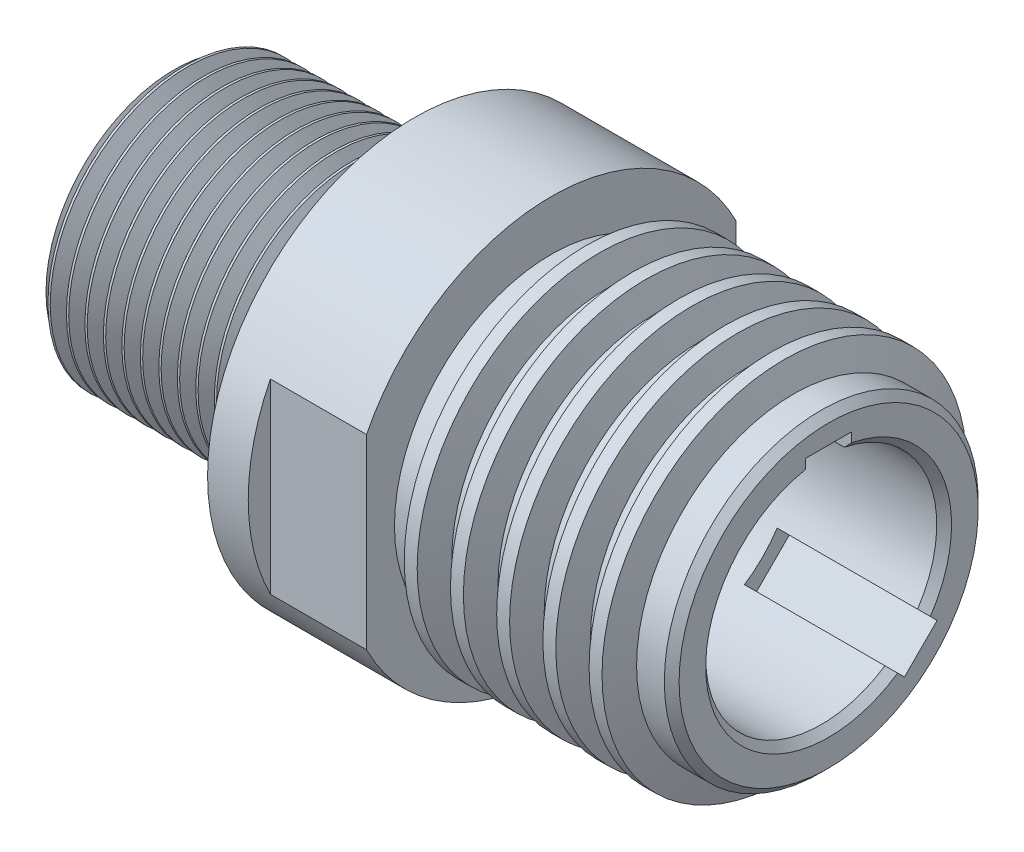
ISO-10303-21;
HEADER;
FILE_DESCRIPTION(('STEP AP214'),'2;1');
FILE_NAME('part.step','',(''),(''),'','','');
FILE_SCHEMA(('AUTOMOTIVE_DESIGN { 1 0 10303 214 1 1 1 1 }'));
ENDSEC;
DATA;
#1=APPLICATION_CONTEXT('core data for automotive mechanical design processes');
#2=APPLICATION_PROTOCOL_DEFINITION('international standard','automotive_design',2000,#1);
#3=PRODUCT_CONTEXT('',#1,'mechanical');
#4=PRODUCT('Part','Part','',(#3));
#5=PRODUCT_RELATED_PRODUCT_CATEGORY('part','',(#4));
#6=PRODUCT_DEFINITION_FORMATION('','',#4);
#7=PRODUCT_DEFINITION_CONTEXT('part definition',#1,'design');
#8=PRODUCT_DEFINITION('design','',#6,#7);
#9=PRODUCT_DEFINITION_SHAPE('','',#8);
#10=(LENGTH_UNIT() NAMED_UNIT(*) SI_UNIT(.MILLI.,.METRE.));
#11=(NAMED_UNIT(*) PLANE_ANGLE_UNIT() SI_UNIT($,.RADIAN.));
#12=(NAMED_UNIT(*) SI_UNIT($,.STERADIAN.) SOLID_ANGLE_UNIT());
#13=UNCERTAINTY_MEASURE_WITH_UNIT(LENGTH_MEASURE(1.E-05),#10,'distance_accuracy_value','');
#14=(GEOMETRIC_REPRESENTATION_CONTEXT(3) GLOBAL_UNCERTAINTY_ASSIGNED_CONTEXT((#13)) GLOBAL_UNIT_ASSIGNED_CONTEXT((#10,
#11,#12)) REPRESENTATION_CONTEXT('',''));
#15=CARTESIAN_POINT('',(0.,0.,0.));
#16=DIRECTION('',(0.,0.,1.));
#17=DIRECTION('',(1.,0.,0.));
#18=AXIS2_PLACEMENT_3D('',#15,#16,#17);
#19=CARTESIAN_POINT('',(53.848,0.,0.));
#20=DIRECTION('',(1.,0.,0.));
#21=DIRECTION('',(0.,0.,-1.));
#22=AXIS2_PLACEMENT_3D('',#19,#20,#21);
#23=CONICAL_SURFACE('',#22,8.4455,0.785398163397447);
#24=CARTESIAN_POINT('',(53.8482,-4.74303241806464,-6.98809644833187));
#25=CARTESIAN_POINT('',(53.7634143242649,-4.68199415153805,-6.92705818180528));
#26=CARTESIAN_POINT('',(53.6786548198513,-4.62093773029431,-6.86600176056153));
#27=CARTESIAN_POINT('',(53.5091881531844,-4.49878857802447,-6.74385260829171));
#28=CARTESIAN_POINT('',(53.4244809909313,-4.43769584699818,-6.68275987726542));
#29=CARTESIAN_POINT('',(53.3398,-4.37658496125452,-6.62164899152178));
#30=B_SPLINE_CURVE_WITH_KNOTS('',3,(#24,#25,#26,#27,#28,#29),.UNSPECIFIED.,.F.,.F.,(4,2,4),(0.,
0.362986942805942,0.725973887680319),.UNSPECIFIED.);
#31=CARTESIAN_POINT('',(53.848,-4.7428884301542,-6.98795246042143));
#32=VERTEX_POINT('',#31);
#33=CARTESIAN_POINT('',(53.3400000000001,-4.3767292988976,-6.62179332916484));
#34=VERTEX_POINT('',#33);
#35=EDGE_CURVE('E43',#32,#34,#30,.T.);
#36=ORIENTED_EDGE('',*,*,#35,.F.);
#37=CARTESIAN_POINT('',(53.848,0.,0.));
#38=DIRECTION('',(-1.,0.,0.));
#39=DIRECTION('',(0.,0.,1.));
#40=AXIS2_PLACEMENT_3D('',#37,#38,#39);
#41=CIRCLE('',#40,8.4455);
#42=CARTESIAN_POINT('',(53.848,8.29495714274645,-1.58749999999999));
#43=VERTEX_POINT('',#42);
#44=EDGE_CURVE('E438',#43,#32,#41,.T.);
#45=ORIENTED_EDGE('',*,*,#44,.F.);
#46=CARTESIAN_POINT('',(49.929335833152,4.23934976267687,-1.58749999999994));
#47=CARTESIAN_POINT('',(50.0683244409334,4.38773835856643,-1.58749999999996));
#48=CARTESIAN_POINT('',(50.2077642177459,4.5357024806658,-1.58749999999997));
#49=CARTESIAN_POINT('',(50.4873667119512,4.83094392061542,-1.58749999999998));
#50=CARTESIAN_POINT('',(50.6275294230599,4.97822124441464,-1.58749999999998));
#51=CARTESIAN_POINT('',(50.9083975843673,5.2722504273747,-1.58749999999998));
#52=CARTESIAN_POINT('',(51.0491030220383,5.41900229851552,-1.58749999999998));
#53=CARTESIAN_POINT('',(51.330948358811,5.71208881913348,-1.58749999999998));
#54=CARTESIAN_POINT('',(51.4720882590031,5.85842346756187,-1.58749999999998));
#55=CARTESIAN_POINT('',(51.8960129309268,6.29691752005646,-1.58749999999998));
#56=CARTESIAN_POINT('',(52.1793134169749,6.5885782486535,-1.58749999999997));
#57=CARTESIAN_POINT('',(52.7468338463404,7.1710065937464,-1.58749999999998));
#58=CARTESIAN_POINT('',(53.0310537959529,7.46177420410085,-1.58749999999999));
#59=CARTESIAN_POINT('',(53.60013166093,8.04266132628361,-1.58749999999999));
#60=CARTESIAN_POINT('',(53.8849895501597,8.33278086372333,-1.58749999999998));
#61=CARTESIAN_POINT('',(54.4551790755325,8.91255223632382,-1.58749999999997));
#62=CARTESIAN_POINT('',(54.7405107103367,9.20220407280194,-1.58749999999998));
#63=CARTESIAN_POINT('',(55.3115399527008,9.78116586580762,-1.58749999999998));
#64=CARTESIAN_POINT('',(55.5972375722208,10.0704758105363,-1.58749999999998));
#65=CARTESIAN_POINT('',(56.1689124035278,10.6488191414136,-1.58749999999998));
#66=CARTESIAN_POINT('',(56.4548896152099,10.937852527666,-1.58749999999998));
#67=CARTESIAN_POINT('',(56.7409683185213,11.2267852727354,-1.58749999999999));
#68=B_SPLINE_CURVE_WITH_KNOTS('',3,(#46,#47,#48,#49,#50,#51,#52,#53,#54,#55,#56,#57,#58,#59,#60,
#61,#62,#63,#64,#65,#66,#67),.UNSPECIFIED.,.F.,.F.,(4,2,2,2,2,2,2,2,2,2,4),(0.,
0.609942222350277,1.2198791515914,1.82980208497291,2.43972655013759,3.65952888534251,
4.8793395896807,6.09910120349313,7.31885937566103,8.53865848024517,9.75845712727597),.UNSPECIFIED.);
#69=CARTESIAN_POINT('',(53.3400000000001,7.77712993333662,-1.58749999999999));
#70=VERTEX_POINT('',#69);
#71=EDGE_CURVE('E446',#70,#43,#68,.T.);
#72=ORIENTED_EDGE('',*,*,#71,.F.);
#73=CARTESIAN_POINT('',(53.3400000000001,0.,0.));
#74=DIRECTION('',(-1.,0.,0.));
#75=DIRECTION('',(0.,0.,1.));
#76=AXIS2_PLACEMENT_3D('',#73,#74,#75);
#77=CIRCLE('',#76,7.93750000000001);
#78=EDGE_CURVE('E58',#34,#70,#77,.F.);
#79=ORIENTED_EDGE('',*,*,#78,.F.);
#80=EDGE_LOOP('',(#36,#45,#72,#79));
#81=FACE_BOUND('',#80,.T.);
#82=ADVANCED_FACE('F34',(#81),#23,.F.);
#83=CARTESIAN_POINT('',(34.798,14.224,0.));
#84=DIRECTION('',(-1.,0.,0.));
#85=DIRECTION('',(0.,0.,1.));
#86=AXIS2_PLACEMENT_3D('',#83,#84,#85);
#87=PLANE('',#86);
#88=CARTESIAN_POINT('',(34.798,0.,0.));
#89=DIRECTION('',(-1.,0.,0.));
#90=DIRECTION('',(0.,0.,1.));
#91=AXIS2_PLACEMENT_3D('',#88,#89,#90);
#92=CIRCLE('',#91,10.7823);
#93=CARTESIAN_POINT('',(34.798,0.,10.7823000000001));
#94=VERTEX_POINT('',#93);
#95=EDGE_CURVE('E353',#94,#94,#92,.T.);
#96=ORIENTED_EDGE('',*,*,#95,.T.);
#97=EDGE_LOOP('',(#96));
#98=FACE_BOUND('',#97,.T.);
#99=DIRECTION('',(0.,-1.,0.));
#100=VECTOR('',#99,1.);
#101=CARTESIAN_POINT('',(34.798,18.5339222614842,12.7000000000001));
#102=LINE('',#101,#100);
#103=CARTESIAN_POINT('',(34.798,6.40563626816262,12.7000000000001));
#104=VERTEX_POINT('',#103);
#105=CARTESIAN_POINT('',(34.798,-6.40563626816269,12.7000000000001));
#106=VERTEX_POINT('',#105);
#107=EDGE_CURVE('E198',#104,#106,#102,.T.);
#108=ORIENTED_EDGE('',*,*,#107,.T.);
#109=CARTESIAN_POINT('',(34.798,0.,0.));
#110=DIRECTION('',(-1.,0.,0.));
#111=DIRECTION('',(0.,0.,1.));
#112=AXIS2_PLACEMENT_3D('',#109,#110,#111);
#113=CIRCLE('',#112,14.224);
#114=CARTESIAN_POINT('',(34.7979999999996,-6.40563626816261,-12.7));
#115=VERTEX_POINT('',#114);
#116=EDGE_CURVE('E349',#115,#106,#113,.T.);
#117=ORIENTED_EDGE('',*,*,#116,.F.);
#118=DIRECTION('',(0.,1.,0.));
#119=VECTOR('',#118,1.);
#120=CARTESIAN_POINT('',(34.7979999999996,18.5339222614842,-12.7));
#121=LINE('',#120,#119);
#122=CARTESIAN_POINT('',(34.7979999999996,6.40563626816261,-12.7));
#123=VERTEX_POINT('',#122);
#124=EDGE_CURVE('E201',#115,#123,#121,.T.);
#125=ORIENTED_EDGE('',*,*,#124,.T.);
#126=EDGE_CURVE('E350',#104,#123,#113,.T.);
#127=ORIENTED_EDGE('',*,*,#126,.F.);
#128=EDGE_LOOP('',(#108,#117,#125,#127));
#129=FACE_BOUND('',#128,.T.);
#130=ADVANCED_FACE('F482',(#98,#129),#87,.F.);
#131=CARTESIAN_POINT('',(-0.860260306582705,0.,0.));
#132=DIRECTION('',(-1.,0.,0.));
#133=DIRECTION('',(0.,0.,1.));
#134=AXIS2_PLACEMENT_3D('',#131,#132,#133);
#135=CYLINDRICAL_SURFACE('',#134,14.224);
#136=CARTESIAN_POINT('',(25.4,0.,0.));
#137=DIRECTION('',(-1.,0.,0.));
#138=DIRECTION('',(0.,0.,1.));
#139=AXIS2_PLACEMENT_3D('',#136,#137,#138);
#140=CIRCLE('',#139,14.224);
#141=CARTESIAN_POINT('',(25.4,0.,14.2240000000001));
#142=VERTEX_POINT('',#141);
#143=EDGE_CURVE('E346',#142,#142,#140,.T.);
#144=ORIENTED_EDGE('',*,*,#143,.F.);
#145=EDGE_LOOP('',(#144));
#146=FACE_BOUND('',#145,.T.);
#147=DIRECTION('',(-1.,0.,0.));
#148=VECTOR('',#147,1.);
#149=CARTESIAN_POINT('',(-0.860260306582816,6.40563626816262,12.7000000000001));
#150=LINE('',#149,#148);
#151=CARTESIAN_POINT('',(28.1939999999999,6.40563626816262,12.7000000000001));
#152=VERTEX_POINT('',#151);
#153=EDGE_CURVE('E432',#104,#152,#150,.T.);
#154=ORIENTED_EDGE('',*,*,#153,.F.);
#155=ORIENTED_EDGE('',*,*,#126,.T.);
#156=DIRECTION('',(-1.,0.,0.));
#157=VECTOR('',#156,1.);
#158=CARTESIAN_POINT('',(-0.860260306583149,6.40563626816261,-12.7));
#159=LINE('',#158,#157);
#160=CARTESIAN_POINT('',(28.1939999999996,6.40563626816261,-12.7));
#161=VERTEX_POINT('',#160);
#162=EDGE_CURVE('E422',#161,#123,#159,.F.);
#163=ORIENTED_EDGE('',*,*,#162,.F.);
#164=CARTESIAN_POINT('',(28.1939999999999,0.,0.));
#165=DIRECTION('',(1.,0.,0.));
#166=DIRECTION('',(0.,0.,-1.));
#167=AXIS2_PLACEMENT_3D('',#164,#165,#166);
#168=CIRCLE('',#167,14.224);
#169=CARTESIAN_POINT('',(28.1939999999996,-6.40563626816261,-12.7000000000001));
#170=VERTEX_POINT('',#169);
#171=EDGE_CURVE('E424',#170,#161,#168,.T.);
#172=ORIENTED_EDGE('',*,*,#171,.F.);
#173=DIRECTION('',(-1.,0.,0.));
#174=VECTOR('',#173,1.);
#175=CARTESIAN_POINT('',(-0.860260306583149,-6.40563626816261,-12.7));
#176=LINE('',#175,#174);
#177=EDGE_CURVE('E427',#115,#170,#176,.T.);
#178=ORIENTED_EDGE('',*,*,#177,.F.);
#179=ORIENTED_EDGE('',*,*,#116,.T.);
#180=DIRECTION('',(-1.,0.,0.));
#181=VECTOR('',#180,1.);
#182=CARTESIAN_POINT('',(-0.860260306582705,-6.40563626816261,12.7000000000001));
#183=LINE('',#182,#181);
#184=CARTESIAN_POINT('',(28.1939999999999,-6.40563626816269,12.7000000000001));
#185=VERTEX_POINT('',#184);
#186=EDGE_CURVE('E430',#185,#106,#183,.F.);
#187=ORIENTED_EDGE('',*,*,#186,.F.);
#188=EDGE_CURVE('E428',#152,#185,#168,.T.);
#189=ORIENTED_EDGE('',*,*,#188,.F.);
#190=EDGE_LOOP('',(#154,#155,#163,#172,#178,#179,#187,#189));
#191=FACE_BOUND('',#190,.T.);
#192=ADVANCED_FACE('F487',(#146,#191),#135,.T.);
#193=CARTESIAN_POINT('',(-0.860260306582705,0.,0.));
#194=DIRECTION('',(-1.,0.,0.));
#195=DIRECTION('',(0.,0.,1.));
#196=AXIS2_PLACEMENT_3D('',#193,#194,#195);
#197=CYLINDRICAL_SURFACE('',#196,5.97244275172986);
#198=CARTESIAN_POINT('',(8.88999999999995,0.,0.));
#199=DIRECTION('',(1.,0.,0.));
#200=DIRECTION('',(0.,0.,-1.));
#201=AXIS2_PLACEMENT_3D('',#198,#199,#200);
#202=CIRCLE('',#201,5.97244275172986);
#203=CARTESIAN_POINT('',(8.88999999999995,0.,-5.97244275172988));
#204=VERTEX_POINT('',#203);
#205=EDGE_CURVE('E541',#204,#204,#202,.F.);
#206=ORIENTED_EDGE('',*,*,#205,.T.);
#207=EDGE_LOOP('',(#206));
#208=FACE_BOUND('',#207,.T.);
#209=CARTESIAN_POINT('',(31.5360132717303,0.,0.));
#210=DIRECTION('',(-1.,0.,0.));
#211=DIRECTION('',(0.,0.,1.));
#212=AXIS2_PLACEMENT_3D('',#209,#210,#211);
#213=CIRCLE('',#212,5.97244275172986);
#214=CARTESIAN_POINT('',(31.5360132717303,0.,5.9724427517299));
#215=VERTEX_POINT('',#214);
#216=EDGE_CURVE('E419',#215,#215,#213,.T.);
#217=ORIENTED_EDGE('',*,*,#216,.F.);
#218=EDGE_LOOP('',(#217));
#219=FACE_BOUND('',#218,.T.);
#220=ADVANCED_FACE('F36',(#208,#219),#197,.F.);
#221=CARTESIAN_POINT('',(31.5360132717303,5.9724427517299,0.));
#222=DIRECTION('',(-1.,0.,0.));
#223=DIRECTION('',(0.,0.,1.));
#224=AXIS2_PLACEMENT_3D('',#221,#222,#223);
#225=PLANE('',#224);
#226=CARTESIAN_POINT('',(31.5360132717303,0.,0.));
#227=DIRECTION('',(-1.,0.,0.));
#228=DIRECTION('',(0.,0.,1.));
#229=AXIS2_PLACEMENT_3D('',#226,#227,#228);
#230=CIRCLE('',#229,7.93750000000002);
#231=CARTESIAN_POINT('',(31.5360132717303,0.,7.93750000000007));
#232=VERTEX_POINT('',#231);
#233=EDGE_CURVE('E416',#232,#232,#230,.T.);
#234=ORIENTED_EDGE('',*,*,#233,.F.);
#235=EDGE_LOOP('',(#234));
#236=FACE_BOUND('',#235,.T.);
#237=ORIENTED_EDGE('',*,*,#216,.T.);
#238=EDGE_LOOP('',(#237));
#239=FACE_BOUND('',#238,.T.);
#240=ADVANCED_FACE('F1350',(#236,#239),#225,.F.);
#241=CARTESIAN_POINT('',(-0.860260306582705,0.,0.));
#242=DIRECTION('',(-1.,0.,0.));
#243=DIRECTION('',(0.,0.,1.));
#244=AXIS2_PLACEMENT_3D('',#241,#242,#243);
#245=CYLINDRICAL_SURFACE('',#244,7.93750000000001);
#246=CARTESIAN_POINT('',(43.6879999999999,0.,0.));
#247=DIRECTION('',(1.,0.,0.));
#248=DIRECTION('',(0.,0.,-1.));
#249=AXIS2_PLACEMENT_3D('',#246,#247,#248);
#250=CIRCLE('',#249,7.93750000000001);
#251=CARTESIAN_POINT('',(43.6879999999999,-4.3767292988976,-6.62179332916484));
#252=VERTEX_POINT('',#251);
#253=CARTESIAN_POINT('',(43.6879999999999,-6.62179332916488,-4.37672929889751));
#254=VERTEX_POINT('',#253);
#255=EDGE_CURVE('E11',#252,#254,#250,.F.);
#256=ORIENTED_EDGE('',*,*,#255,.F.);
#257=DIRECTION('',(-1.,0.,0.));
#258=VECTOR('',#257,1.);
#259=CARTESIAN_POINT('',(-0.860260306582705,-4.3767292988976,-6.62179332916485));
#260=LINE('',#259,#258);
#261=EDGE_CURVE('E170',#252,#34,#260,.F.);
#262=ORIENTED_EDGE('',*,*,#261,.T.);
#263=ORIENTED_EDGE('',*,*,#78,.T.);
#264=DIRECTION('',(-1.,0.,0.));
#265=VECTOR('',#264,1.);
#266=CARTESIAN_POINT('',(-0.860260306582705,7.7771299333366,-1.58749999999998));
#267=LINE('',#266,#265);
#268=CARTESIAN_POINT('',(43.6879999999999,7.77712993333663,-1.58749999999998));
#269=VERTEX_POINT('',#268);
#270=EDGE_CURVE('E191',#70,#269,#267,.T.);
#271=ORIENTED_EDGE('',*,*,#270,.T.);
#272=CARTESIAN_POINT('',(43.6879999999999,0.,0.));
#273=DIRECTION('',(1.,0.,0.));
#274=DIRECTION('',(0.,0.,-1.));
#275=AXIS2_PLACEMENT_3D('',#272,#273,#274);
#276=CIRCLE('',#275,7.93750000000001);
#277=CARTESIAN_POINT('',(43.6879999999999,7.77712993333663,1.58750000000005));
#278=VERTEX_POINT('',#277);
#279=EDGE_CURVE('E501',#278,#269,#276,.F.);
#280=ORIENTED_EDGE('',*,*,#279,.F.);
#281=DIRECTION('',(-1.,0.,0.));
#282=VECTOR('',#281,1.);
#283=CARTESIAN_POINT('',(-0.860260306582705,7.7771299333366,1.58750000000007));
#284=LINE('',#283,#282);
#285=CARTESIAN_POINT('',(53.3399999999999,7.77712993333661,1.58750000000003));
#286=VERTEX_POINT('',#285);
#287=EDGE_CURVE('E195',#278,#286,#284,.F.);
#288=ORIENTED_EDGE('',*,*,#287,.T.);
#289=CARTESIAN_POINT('',(53.3400000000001,-6.62179332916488,-4.37672929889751));
#290=VERTEX_POINT('',#289);
#291=EDGE_CURVE('E443',#286,#290,#77,.F.);
#292=ORIENTED_EDGE('',*,*,#291,.T.);
#293=DIRECTION('',(-1.,0.,0.));
#294=VECTOR('',#293,1.);
#295=CARTESIAN_POINT('',(-0.860260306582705,-6.62179332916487,-4.37672929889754));
#296=LINE('',#295,#294);
#297=EDGE_CURVE('E50',#290,#254,#296,.T.);
#298=ORIENTED_EDGE('',*,*,#297,.T.);
#299=EDGE_LOOP('',(#256,#262,#263,#271,#280,#288,#292,#298));
#300=FACE_BOUND('',#299,.T.);
#301=ORIENTED_EDGE('',*,*,#233,.T.);
#302=EDGE_LOOP('',(#301));
#303=FACE_BOUND('',#302,.T.);
#304=ADVANCED_FACE('F504',(#300,#303),#245,.F.);
#305=CARTESIAN_POINT('',(53.848,10.7823,0.));
#306=DIRECTION('',(-1.,0.,0.));
#307=DIRECTION('',(0.,0.,1.));
#308=AXIS2_PLACEMENT_3D('',#305,#306,#307);
#309=PLANE('',#308);
#310=CARTESIAN_POINT('',(53.848,0.,0.));
#311=DIRECTION('',(-1.,0.,0.));
#312=DIRECTION('',(0.,0.,1.));
#313=AXIS2_PLACEMENT_3D('',#310,#311,#312);
#314=CIRCLE('',#313,10.2743);
#315=CARTESIAN_POINT('',(53.848,0.,10.2743000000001));
#316=VERTEX_POINT('',#315);
#317=EDGE_CURVE('E440',#316,#316,#314,.F.);
#318=ORIENTED_EDGE('',*,*,#317,.T.);
#319=EDGE_LOOP('',(#318));
#320=FACE_BOUND('',#319,.T.);
#321=ORIENTED_EDGE('',*,*,#44,.T.);
#322=DIRECTION('',(0.,0.707106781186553,0.707106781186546));
#323=VECTOR('',#322,1.);
#324=CARTESIAN_POINT('',(53.848,-5.20854855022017,-7.45361258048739));
#325=LINE('',#324,#323);
#326=CARTESIAN_POINT('',(53.848,-5.20854855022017,-7.45361258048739));
#327=VERTEX_POINT('',#326);
#328=EDGE_CURVE('E147',#327,#32,#325,.T.);
#329=ORIENTED_EDGE('',*,*,#328,.F.);
#330=DIRECTION('',(0.,0.707106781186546,-0.707106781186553));
#331=VECTOR('',#330,1.);
#332=CARTESIAN_POINT('',(53.848,-5.20854855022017,-7.45361258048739));
#333=LINE('',#332,#331);
#334=CARTESIAN_POINT('',(53.848,-7.45361258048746,-5.20854855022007));
#335=VERTEX_POINT('',#334);
#336=EDGE_CURVE('E146',#335,#327,#333,.T.);
#337=ORIENTED_EDGE('',*,*,#336,.F.);
#338=DIRECTION('',(0.,-0.707106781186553,-0.707106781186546));
#339=VECTOR('',#338,1.);
#340=CARTESIAN_POINT('',(53.848,-7.45361258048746,-5.20854855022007));
#341=LINE('',#340,#339);
#342=CARTESIAN_POINT('',(53.848,-6.98795246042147,-4.74288843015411));
#343=VERTEX_POINT('',#342);
#344=EDGE_CURVE('E137',#343,#335,#341,.T.);
#345=ORIENTED_EDGE('',*,*,#344,.F.);
#346=CARTESIAN_POINT('',(53.848,8.29495714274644,1.58750000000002));
#347=VERTEX_POINT('',#346);
#348=EDGE_CURVE('E437',#343,#347,#41,.T.);
#349=ORIENTED_EDGE('',*,*,#348,.T.);
#350=DIRECTION('',(0.,-1.,0.));
#351=VECTOR('',#350,1.);
#352=CARTESIAN_POINT('',(53.848,8.95350000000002,1.58750000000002));
#353=LINE('',#352,#351);
#354=CARTESIAN_POINT('',(53.848,8.95350000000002,1.58750000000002));
#355=VERTEX_POINT('',#354);
#356=EDGE_CURVE('E172',#355,#347,#353,.T.);
#357=ORIENTED_EDGE('',*,*,#356,.F.);
#358=DIRECTION('',(0.,0.,1.));
#359=VECTOR('',#358,1.);
#360=CARTESIAN_POINT('',(53.848,8.95350000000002,1.58750000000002));
#361=LINE('',#360,#359);
#362=CARTESIAN_POINT('',(53.848,8.95350000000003,-1.58749999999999));
#363=VERTEX_POINT('',#362);
#364=EDGE_CURVE('E177',#363,#355,#361,.T.);
#365=ORIENTED_EDGE('',*,*,#364,.F.);
#366=DIRECTION('',(0.,1.,0.));
#367=VECTOR('',#366,1.);
#368=CARTESIAN_POINT('',(53.848,8.95350000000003,-1.58749999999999));
#369=LINE('',#368,#367);
#370=EDGE_CURVE('E175',#43,#363,#369,.T.);
#371=ORIENTED_EDGE('',*,*,#370,.F.);
#372=EDGE_LOOP('',(#321,#329,#337,#345,#349,#357,#365,#371));
#373=FACE_BOUND('',#372,.T.);
#374=ADVANCED_FACE('F158',(#320,#373),#309,.F.);
#375=CARTESIAN_POINT('',(-0.860260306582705,0.,0.));
#376=DIRECTION('',(-1.,0.,0.));
#377=DIRECTION('',(0.,0.,1.));
#378=AXIS2_PLACEMENT_3D('',#375,#376,#377);
#379=CYLINDRICAL_SURFACE('',#378,10.7823);
#380=CARTESIAN_POINT('',(53.3400000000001,0.,0.));
#381=DIRECTION('',(-1.,0.,0.));
#382=DIRECTION('',(0.,0.,1.));
#383=AXIS2_PLACEMENT_3D('',#380,#381,#382);
#384=CIRCLE('',#383,10.7823);
#385=CARTESIAN_POINT('',(53.3400000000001,0.,10.7823000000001));
#386=VERTEX_POINT('',#385);
#387=EDGE_CURVE('E434',#386,#386,#384,.T.);
#388=ORIENTED_EDGE('',*,*,#387,.T.);
#389=EDGE_LOOP('',(#388));
#390=FACE_BOUND('',#389,.T.);
#391=CARTESIAN_POINT('',(51.435,0.,0.));
#392=DIRECTION('',(-1.,0.,0.));
#393=DIRECTION('',(0.,0.,1.));
#394=AXIS2_PLACEMENT_3D('',#391,#392,#393);
#395=CIRCLE('',#394,10.7823);
#396=CARTESIAN_POINT('',(51.435,0.,10.7823));
#397=VERTEX_POINT('',#396);
#398=EDGE_CURVE('E413',#397,#397,#395,.T.);
#399=ORIENTED_EDGE('',*,*,#398,.F.);
#400=EDGE_LOOP('',(#399));
#401=FACE_BOUND('',#400,.T.);
#402=ADVANCED_FACE('F1319',(#390,#401),#379,.T.);
#403=CARTESIAN_POINT('',(51.435,0.,0.));
#404=DIRECTION('',(-1.,0.,0.));
#405=DIRECTION('',(0.,0.,1.));
#406=AXIS2_PLACEMENT_3D('',#403,#404,#405);
#407=CONICAL_SURFACE('',#406,10.7823,1.22085367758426);
#408=CARTESIAN_POINT('',(50.8,0.,0.));
#409=DIRECTION('',(-1.,0.,0.));
#410=DIRECTION('',(0.,0.,1.));
#411=AXIS2_PLACEMENT_3D('',#408,#409,#410);
#412=CIRCLE('',#411,12.5222);
#413=CARTESIAN_POINT('',(50.8,0.,12.5222000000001));
#414=VERTEX_POINT('',#413);
#415=EDGE_CURVE('E410',#414,#414,#412,.T.);
#416=ORIENTED_EDGE('',*,*,#415,.F.);
#417=EDGE_LOOP('',(#416));
#418=FACE_BOUND('',#417,.T.);
#419=ORIENTED_EDGE('',*,*,#398,.T.);
#420=EDGE_LOOP('',(#419));
#421=FACE_BOUND('',#420,.T.);
#422=ADVANCED_FACE('F1309',(#418,#421),#407,.T.);
#423=CARTESIAN_POINT('',(-0.860260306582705,0.,0.));
#424=DIRECTION('',(-1.,0.,0.));
#425=DIRECTION('',(0.,0.,1.));
#426=AXIS2_PLACEMENT_3D('',#423,#424,#425);
#427=CYLINDRICAL_SURFACE('',#426,12.5222);
#428=CARTESIAN_POINT('',(49.9109999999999,0.,0.));
#429=DIRECTION('',(-1.,0.,0.));
#430=DIRECTION('',(0.,0.,1.));
#431=AXIS2_PLACEMENT_3D('',#428,#429,#430);
#432=CIRCLE('',#431,12.5222);
#433=CARTESIAN_POINT('',(49.9109999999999,0.,12.5222000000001));
#434=VERTEX_POINT('',#433);
#435=EDGE_CURVE('E407',#434,#434,#432,.T.);
#436=ORIENTED_EDGE('',*,*,#435,.F.);
#437=EDGE_LOOP('',(#436));
#438=FACE_BOUND('',#437,.T.);
#439=ORIENTED_EDGE('',*,*,#415,.T.);
#440=EDGE_LOOP('',(#439));
#441=FACE_BOUND('',#440,.T.);
#442=ADVANCED_FACE('F1299',(#438,#441),#427,.T.);
#443=CARTESIAN_POINT('',(49.9109999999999,0.,0.));
#444=DIRECTION('',(1.,0.,0.));
#445=DIRECTION('',(0.,0.,-1.));
#446=AXIS2_PLACEMENT_3D('',#443,#444,#445);
#447=CONICAL_SURFACE('',#446,12.5222,1.22085367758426);
#448=CARTESIAN_POINT('',(49.276,0.,0.));
#449=DIRECTION('',(-1.,0.,0.));
#450=DIRECTION('',(0.,0.,1.));
#451=AXIS2_PLACEMENT_3D('',#448,#449,#450);
#452=CIRCLE('',#451,10.7823);
#453=CARTESIAN_POINT('',(49.276,0.,10.7823000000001));
#454=VERTEX_POINT('',#453);
#455=EDGE_CURVE('E404',#454,#454,#452,.T.);
#456=ORIENTED_EDGE('',*,*,#455,.F.);
#457=EDGE_LOOP('',(#456));
#458=FACE_BOUND('',#457,.T.);
#459=ORIENTED_EDGE('',*,*,#435,.T.);
#460=EDGE_LOOP('',(#459));
#461=FACE_BOUND('',#460,.T.);
#462=ADVANCED_FACE('F1289',(#458,#461),#447,.T.);
#463=CARTESIAN_POINT('',(-0.860260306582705,0.,0.));
#464=DIRECTION('',(-1.,0.,0.));
#465=DIRECTION('',(0.,0.,1.));
#466=AXIS2_PLACEMENT_3D('',#463,#464,#465);
#467=CYLINDRICAL_SURFACE('',#466,10.7823);
#468=CARTESIAN_POINT('',(48.26,0.,0.));
#469=DIRECTION('',(-1.,0.,0.));
#470=DIRECTION('',(0.,0.,1.));
#471=AXIS2_PLACEMENT_3D('',#468,#469,#470);
#472=CIRCLE('',#471,10.7823);
#473=CARTESIAN_POINT('',(48.26,0.,10.7823000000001));
#474=VERTEX_POINT('',#473);
#475=EDGE_CURVE('E401',#474,#474,#472,.T.);
#476=ORIENTED_EDGE('',*,*,#475,.F.);
#477=EDGE_LOOP('',(#476));
#478=FACE_BOUND('',#477,.T.);
#479=ORIENTED_EDGE('',*,*,#455,.T.);
#480=EDGE_LOOP('',(#479));
#481=FACE_BOUND('',#480,.T.);
#482=ADVANCED_FACE('F1279',(#478,#481),#467,.T.);
#483=CARTESIAN_POINT('',(48.26,0.,0.));
#484=DIRECTION('',(-1.,0.,0.));
#485=DIRECTION('',(0.,0.,1.));
#486=AXIS2_PLACEMENT_3D('',#483,#484,#485);
#487=CONICAL_SURFACE('',#486,10.7823,1.22085367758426);
#488=CARTESIAN_POINT('',(47.625,0.,0.));
#489=DIRECTION('',(-1.,0.,0.));
#490=DIRECTION('',(0.,0.,1.));
#491=AXIS2_PLACEMENT_3D('',#488,#489,#490);
#492=CIRCLE('',#491,12.5222);
#493=CARTESIAN_POINT('',(47.625,0.,12.5222000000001));
#494=VERTEX_POINT('',#493);
#495=EDGE_CURVE('E398',#494,#494,#492,.T.);
#496=ORIENTED_EDGE('',*,*,#495,.F.);
#497=EDGE_LOOP('',(#496));
#498=FACE_BOUND('',#497,.T.);
#499=ORIENTED_EDGE('',*,*,#475,.T.);
#500=EDGE_LOOP('',(#499));
#501=FACE_BOUND('',#500,.T.);
#502=ADVANCED_FACE('F1269',(#498,#501),#487,.T.);
#503=CARTESIAN_POINT('',(-0.860260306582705,0.,0.));
#504=DIRECTION('',(-1.,0.,0.));
#505=DIRECTION('',(0.,0.,1.));
#506=AXIS2_PLACEMENT_3D('',#503,#504,#505);
#507=CYLINDRICAL_SURFACE('',#506,12.5222);
#508=CARTESIAN_POINT('',(46.736,0.,0.));
#509=DIRECTION('',(-1.,0.,0.));
#510=DIRECTION('',(0.,0.,1.));
#511=AXIS2_PLACEMENT_3D('',#508,#509,#510);
#512=CIRCLE('',#511,12.5222);
#513=CARTESIAN_POINT('',(46.736,0.,12.5222000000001));
#514=VERTEX_POINT('',#513);
#515=EDGE_CURVE('E395',#514,#514,#512,.T.);
#516=ORIENTED_EDGE('',*,*,#515,.F.);
#517=EDGE_LOOP('',(#516));
#518=FACE_BOUND('',#517,.T.);
#519=ORIENTED_EDGE('',*,*,#495,.T.);
#520=EDGE_LOOP('',(#519));
#521=FACE_BOUND('',#520,.T.);
#522=ADVANCED_FACE('F1259',(#518,#521),#507,.T.);
#523=CARTESIAN_POINT('',(46.736,0.,0.));
#524=DIRECTION('',(1.,0.,0.));
#525=DIRECTION('',(0.,0.,-1.));
#526=AXIS2_PLACEMENT_3D('',#523,#524,#525);
#527=CONICAL_SURFACE('',#526,12.5222,1.22085367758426);
#528=CARTESIAN_POINT('',(46.1009999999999,0.,0.));
#529=DIRECTION('',(-1.,0.,0.));
#530=DIRECTION('',(0.,0.,1.));
#531=AXIS2_PLACEMENT_3D('',#528,#529,#530);
#532=CIRCLE('',#531,10.7823);
#533=CARTESIAN_POINT('',(46.1009999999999,0.,10.7823000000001));
#534=VERTEX_POINT('',#533);
#535=EDGE_CURVE('E392',#534,#534,#532,.T.);
#536=ORIENTED_EDGE('',*,*,#535,.F.);
#537=EDGE_LOOP('',(#536));
#538=FACE_BOUND('',#537,.T.);
#539=ORIENTED_EDGE('',*,*,#515,.T.);
#540=EDGE_LOOP('',(#539));
#541=FACE_BOUND('',#540,.T.);
#542=ADVANCED_FACE('F1249',(#538,#541),#527,.T.);
#543=CARTESIAN_POINT('',(-0.860260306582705,0.,0.));
#544=DIRECTION('',(-1.,0.,0.));
#545=DIRECTION('',(0.,0.,1.));
#546=AXIS2_PLACEMENT_3D('',#543,#544,#545);
#547=CYLINDRICAL_SURFACE('',#546,10.7823);
#548=CARTESIAN_POINT('',(45.0849999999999,0.,0.));
#549=DIRECTION('',(-1.,0.,0.));
#550=DIRECTION('',(0.,0.,1.));
#551=AXIS2_PLACEMENT_3D('',#548,#549,#550);
#552=CIRCLE('',#551,10.7823);
#553=CARTESIAN_POINT('',(45.0849999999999,0.,10.7823000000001));
#554=VERTEX_POINT('',#553);
#555=EDGE_CURVE('E389',#554,#554,#552,.T.);
#556=ORIENTED_EDGE('',*,*,#555,.F.);
#557=EDGE_LOOP('',(#556));
#558=FACE_BOUND('',#557,.T.);
#559=ORIENTED_EDGE('',*,*,#535,.T.);
#560=EDGE_LOOP('',(#559));
#561=FACE_BOUND('',#560,.T.);
#562=ADVANCED_FACE('F1239',(#558,#561),#547,.T.);
#563=CARTESIAN_POINT('',(45.0849999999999,0.,0.));
#564=DIRECTION('',(-1.,0.,0.));
#565=DIRECTION('',(0.,0.,1.));
#566=AXIS2_PLACEMENT_3D('',#563,#564,#565);
#567=CONICAL_SURFACE('',#566,10.7823,1.22085367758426);
#568=CARTESIAN_POINT('',(44.45,0.,0.));
#569=DIRECTION('',(-1.,0.,0.));
#570=DIRECTION('',(0.,0.,1.));
#571=AXIS2_PLACEMENT_3D('',#568,#569,#570);
#572=CIRCLE('',#571,12.5222);
#573=CARTESIAN_POINT('',(44.45,0.,12.5222000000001));
#574=VERTEX_POINT('',#573);
#575=EDGE_CURVE('E386',#574,#574,#572,.T.);
#576=ORIENTED_EDGE('',*,*,#575,.F.);
#577=EDGE_LOOP('',(#576));
#578=FACE_BOUND('',#577,.T.);
#579=ORIENTED_EDGE('',*,*,#555,.T.);
#580=EDGE_LOOP('',(#579));
#581=FACE_BOUND('',#580,.T.);
#582=ADVANCED_FACE('F1229',(#578,#581),#567,.T.);
#583=CARTESIAN_POINT('',(-0.860260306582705,0.,0.));
#584=DIRECTION('',(-1.,0.,0.));
#585=DIRECTION('',(0.,0.,1.));
#586=AXIS2_PLACEMENT_3D('',#583,#584,#585);
#587=CYLINDRICAL_SURFACE('',#586,12.5222);
#588=CARTESIAN_POINT('',(43.561,0.,0.));
#589=DIRECTION('',(-1.,0.,0.));
#590=DIRECTION('',(0.,0.,1.));
#591=AXIS2_PLACEMENT_3D('',#588,#589,#590);
#592=CIRCLE('',#591,12.5222);
#593=CARTESIAN_POINT('',(43.561,0.,12.5222000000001));
#594=VERTEX_POINT('',#593);
#595=EDGE_CURVE('E383',#594,#594,#592,.T.);
#596=ORIENTED_EDGE('',*,*,#595,.F.);
#597=EDGE_LOOP('',(#596));
#598=FACE_BOUND('',#597,.T.);
#599=ORIENTED_EDGE('',*,*,#575,.T.);
#600=EDGE_LOOP('',(#599));
#601=FACE_BOUND('',#600,.T.);
#602=ADVANCED_FACE('F1219',(#598,#601),#587,.T.);
#603=CARTESIAN_POINT('',(43.561,0.,0.));
#604=DIRECTION('',(1.,0.,0.));
#605=DIRECTION('',(0.,0.,-1.));
#606=AXIS2_PLACEMENT_3D('',#603,#604,#605);
#607=CONICAL_SURFACE('',#606,12.5222,1.22085367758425);
#608=CARTESIAN_POINT('',(42.926,0.,0.));
#609=DIRECTION('',(-1.,0.,0.));
#610=DIRECTION('',(0.,0.,1.));
#611=AXIS2_PLACEMENT_3D('',#608,#609,#610);
#612=CIRCLE('',#611,10.7823);
#613=CARTESIAN_POINT('',(42.926,0.,10.7823000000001));
#614=VERTEX_POINT('',#613);
#615=EDGE_CURVE('E380',#614,#614,#612,.T.);
#616=ORIENTED_EDGE('',*,*,#615,.F.);
#617=EDGE_LOOP('',(#616));
#618=FACE_BOUND('',#617,.T.);
#619=ORIENTED_EDGE('',*,*,#595,.T.);
#620=EDGE_LOOP('',(#619));
#621=FACE_BOUND('',#620,.T.);
#622=ADVANCED_FACE('F1209',(#618,#621),#607,.T.);
#623=CARTESIAN_POINT('',(-0.860260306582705,0.,0.));
#624=DIRECTION('',(-1.,0.,0.));
#625=DIRECTION('',(0.,0.,1.));
#626=AXIS2_PLACEMENT_3D('',#623,#624,#625);
#627=CYLINDRICAL_SURFACE('',#626,10.7823);
#628=CARTESIAN_POINT('',(41.91,0.,0.));
#629=DIRECTION('',(-1.,0.,0.));
#630=DIRECTION('',(0.,0.,1.));
#631=AXIS2_PLACEMENT_3D('',#628,#629,#630);
#632=CIRCLE('',#631,10.7823);
#633=CARTESIAN_POINT('',(41.91,0.,10.7823000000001));
#634=VERTEX_POINT('',#633);
#635=EDGE_CURVE('E377',#634,#634,#632,.T.);
#636=ORIENTED_EDGE('',*,*,#635,.F.);
#637=EDGE_LOOP('',(#636));
#638=FACE_BOUND('',#637,.T.);
#639=ORIENTED_EDGE('',*,*,#615,.T.);
#640=EDGE_LOOP('',(#639));
#641=FACE_BOUND('',#640,.T.);
#642=ADVANCED_FACE('F1199',(#638,#641),#627,.T.);
#643=CARTESIAN_POINT('',(41.91,0.,0.));
#644=DIRECTION('',(-1.,0.,0.));
#645=DIRECTION('',(0.,0.,1.));
#646=AXIS2_PLACEMENT_3D('',#643,#644,#645);
#647=CONICAL_SURFACE('',#646,10.7823,1.22085367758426);
#648=CARTESIAN_POINT('',(41.2749999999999,0.,0.));
#649=DIRECTION('',(-1.,0.,0.));
#650=DIRECTION('',(0.,0.,1.));
#651=AXIS2_PLACEMENT_3D('',#648,#649,#650);
#652=CIRCLE('',#651,12.5222);
#653=CARTESIAN_POINT('',(41.2749999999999,0.,12.5222000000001));
#654=VERTEX_POINT('',#653);
#655=EDGE_CURVE('E374',#654,#654,#652,.T.);
#656=ORIENTED_EDGE('',*,*,#655,.F.);
#657=EDGE_LOOP('',(#656));
#658=FACE_BOUND('',#657,.T.);
#659=ORIENTED_EDGE('',*,*,#635,.T.);
#660=EDGE_LOOP('',(#659));
#661=FACE_BOUND('',#660,.T.);
#662=ADVANCED_FACE('F1189',(#658,#661),#647,.T.);
#663=CARTESIAN_POINT('',(-0.860260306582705,0.,0.));
#664=DIRECTION('',(-1.,0.,0.));
#665=DIRECTION('',(0.,0.,1.));
#666=AXIS2_PLACEMENT_3D('',#663,#664,#665);
#667=CYLINDRICAL_SURFACE('',#666,12.5222);
#668=CARTESIAN_POINT('',(40.3859999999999,0.,0.));
#669=DIRECTION('',(-1.,0.,0.));
#670=DIRECTION('',(0.,0.,1.));
#671=AXIS2_PLACEMENT_3D('',#668,#669,#670);
#672=CIRCLE('',#671,12.5222);
#673=CARTESIAN_POINT('',(40.3859999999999,0.,12.5222000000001));
#674=VERTEX_POINT('',#673);
#675=EDGE_CURVE('E371',#674,#674,#672,.T.);
#676=ORIENTED_EDGE('',*,*,#675,.F.);
#677=EDGE_LOOP('',(#676));
#678=FACE_BOUND('',#677,.T.);
#679=ORIENTED_EDGE('',*,*,#655,.T.);
#680=EDGE_LOOP('',(#679));
#681=FACE_BOUND('',#680,.T.);
#682=ADVANCED_FACE('F1179',(#678,#681),#667,.T.);
#683=CARTESIAN_POINT('',(40.3859999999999,0.,0.));
#684=DIRECTION('',(1.,0.,0.));
#685=DIRECTION('',(0.,0.,-1.));
#686=AXIS2_PLACEMENT_3D('',#683,#684,#685);
#687=CONICAL_SURFACE('',#686,12.5222,1.22085367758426);
#688=CARTESIAN_POINT('',(39.751,0.,0.));
#689=DIRECTION('',(-1.,0.,0.));
#690=DIRECTION('',(0.,0.,1.));
#691=AXIS2_PLACEMENT_3D('',#688,#689,#690);
#692=CIRCLE('',#691,10.7823);
#693=CARTESIAN_POINT('',(39.751,0.,10.7823000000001));
#694=VERTEX_POINT('',#693);
#695=EDGE_CURVE('E368',#694,#694,#692,.T.);
#696=ORIENTED_EDGE('',*,*,#695,.F.);
#697=EDGE_LOOP('',(#696));
#698=FACE_BOUND('',#697,.T.);
#699=ORIENTED_EDGE('',*,*,#675,.T.);
#700=EDGE_LOOP('',(#699));
#701=FACE_BOUND('',#700,.T.);
#702=ADVANCED_FACE('F1169',(#698,#701),#687,.T.);
#703=CARTESIAN_POINT('',(-0.860260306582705,0.,0.));
#704=DIRECTION('',(-1.,0.,0.));
#705=DIRECTION('',(0.,0.,1.));
#706=AXIS2_PLACEMENT_3D('',#703,#704,#705);
#707=CYLINDRICAL_SURFACE('',#706,10.7823);
#708=CARTESIAN_POINT('',(38.735,0.,0.));
#709=DIRECTION('',(-1.,0.,0.));
#710=DIRECTION('',(0.,0.,1.));
#711=AXIS2_PLACEMENT_3D('',#708,#709,#710);
#712=CIRCLE('',#711,10.7823);
#713=CARTESIAN_POINT('',(38.735,0.,10.7823000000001));
#714=VERTEX_POINT('',#713);
#715=EDGE_CURVE('E365',#714,#714,#712,.T.);
#716=ORIENTED_EDGE('',*,*,#715,.F.);
#717=EDGE_LOOP('',(#716));
#718=FACE_BOUND('',#717,.T.);
#719=ORIENTED_EDGE('',*,*,#695,.T.);
#720=EDGE_LOOP('',(#719));
#721=FACE_BOUND('',#720,.T.);
#722=ADVANCED_FACE('F1159',(#718,#721),#707,.T.);
#723=CARTESIAN_POINT('',(38.735,0.,0.));
#724=DIRECTION('',(-1.,0.,0.));
#725=DIRECTION('',(0.,0.,1.));
#726=AXIS2_PLACEMENT_3D('',#723,#724,#725);
#727=CONICAL_SURFACE('',#726,10.7823,1.22085367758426);
#728=CARTESIAN_POINT('',(38.1,0.,0.));
#729=DIRECTION('',(-1.,0.,0.));
#730=DIRECTION('',(0.,0.,1.));
#731=AXIS2_PLACEMENT_3D('',#728,#729,#730);
#732=CIRCLE('',#731,12.5222);
#733=CARTESIAN_POINT('',(38.1,0.,12.5222000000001));
#734=VERTEX_POINT('',#733);
#735=EDGE_CURVE('E362',#734,#734,#732,.T.);
#736=ORIENTED_EDGE('',*,*,#735,.F.);
#737=EDGE_LOOP('',(#736));
#738=FACE_BOUND('',#737,.T.);
#739=ORIENTED_EDGE('',*,*,#715,.T.);
#740=EDGE_LOOP('',(#739));
#741=FACE_BOUND('',#740,.T.);
#742=ADVANCED_FACE('F1149',(#738,#741),#727,.T.);
#743=CARTESIAN_POINT('',(-0.860260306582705,0.,0.));
#744=DIRECTION('',(-1.,0.,0.));
#745=DIRECTION('',(0.,0.,1.));
#746=AXIS2_PLACEMENT_3D('',#743,#744,#745);
#747=CYLINDRICAL_SURFACE('',#746,12.5222);
#748=CARTESIAN_POINT('',(37.211,0.,0.));
#749=DIRECTION('',(-1.,0.,0.));
#750=DIRECTION('',(0.,0.,1.));
#751=AXIS2_PLACEMENT_3D('',#748,#749,#750);
#752=CIRCLE('',#751,12.5222);
#753=CARTESIAN_POINT('',(37.211,0.,12.5222000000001));
#754=VERTEX_POINT('',#753);
#755=EDGE_CURVE('E359',#754,#754,#752,.T.);
#756=ORIENTED_EDGE('',*,*,#755,.F.);
#757=EDGE_LOOP('',(#756));
#758=FACE_BOUND('',#757,.T.);
#759=ORIENTED_EDGE('',*,*,#735,.T.);
#760=EDGE_LOOP('',(#759));
#761=FACE_BOUND('',#760,.T.);
#762=ADVANCED_FACE('F1139',(#758,#761),#747,.T.);
#763=CARTESIAN_POINT('',(37.211,0.,0.));
#764=DIRECTION('',(1.,0.,0.));
#765=DIRECTION('',(0.,0.,-1.));
#766=AXIS2_PLACEMENT_3D('',#763,#764,#765);
#767=CONICAL_SURFACE('',#766,12.5222,1.22085367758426);
#768=CARTESIAN_POINT('',(36.5760000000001,0.,0.));
#769=DIRECTION('',(-1.,0.,0.));
#770=DIRECTION('',(0.,0.,1.));
#771=AXIS2_PLACEMENT_3D('',#768,#769,#770);
#772=CIRCLE('',#771,10.7823);
#773=CARTESIAN_POINT('',(36.5760000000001,0.,10.7823000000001));
#774=VERTEX_POINT('',#773);
#775=EDGE_CURVE('E356',#774,#774,#772,.T.);
#776=ORIENTED_EDGE('',*,*,#775,.F.);
#777=EDGE_LOOP('',(#776));
#778=FACE_BOUND('',#777,.T.);
#779=ORIENTED_EDGE('',*,*,#755,.T.);
#780=EDGE_LOOP('',(#779));
#781=FACE_BOUND('',#780,.T.);
#782=ADVANCED_FACE('F1129',(#778,#781),#767,.T.);
#783=CARTESIAN_POINT('',(-0.860260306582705,0.,0.));
#784=DIRECTION('',(-1.,0.,0.));
#785=DIRECTION('',(0.,0.,1.));
#786=AXIS2_PLACEMENT_3D('',#783,#784,#785);
#787=CYLINDRICAL_SURFACE('',#786,10.7823);
#788=ORIENTED_EDGE('',*,*,#95,.F.);
#789=EDGE_LOOP('',(#788));
#790=FACE_BOUND('',#789,.T.);
#791=ORIENTED_EDGE('',*,*,#775,.T.);
#792=EDGE_LOOP('',(#791));
#793=FACE_BOUND('',#792,.T.);
#794=ADVANCED_FACE('F1118',(#790,#793),#787,.T.);
#795=CARTESIAN_POINT('',(25.4,11.9634,0.));
#796=DIRECTION('',(1.,0.,0.));
#797=DIRECTION('',(0.,0.,-1.));
#798=AXIS2_PLACEMENT_3D('',#795,#796,#797);
#799=PLANE('',#798);
#800=CARTESIAN_POINT('',(25.4,0.,0.));
#801=DIRECTION('',(-1.,0.,0.));
#802=DIRECTION('',(0.,0.,1.));
#803=AXIS2_PLACEMENT_3D('',#800,#801,#802);
#804=CIRCLE('',#803,11.9634);
#805=CARTESIAN_POINT('',(25.4,0.,11.9634000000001));
#806=VERTEX_POINT('',#805);
#807=EDGE_CURVE('E343',#806,#806,#804,.T.);
#808=ORIENTED_EDGE('',*,*,#807,.F.);
#809=EDGE_LOOP('',(#808));
#810=FACE_BOUND('',#809,.T.);
#811=ORIENTED_EDGE('',*,*,#143,.T.);
#812=EDGE_LOOP('',(#811));
#813=FACE_BOUND('',#812,.T.);
#814=ADVANCED_FACE('F1108',(#810,#813),#799,.F.);
#815=CARTESIAN_POINT('',(-0.860260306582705,0.,0.));
#816=DIRECTION('',(-1.,0.,0.));
#817=DIRECTION('',(0.,0.,1.));
#818=AXIS2_PLACEMENT_3D('',#815,#816,#817);
#819=CYLINDRICAL_SURFACE('',#818,11.9634);
#820=CARTESIAN_POINT('',(27.0002,0.,0.));
#821=DIRECTION('',(-1.,0.,0.));
#822=DIRECTION('',(0.,0.,1.));
#823=AXIS2_PLACEMENT_3D('',#820,#821,#822);
#824=CIRCLE('',#823,11.9634);
#825=CARTESIAN_POINT('',(27.0002,0.,11.9634000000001));
#826=VERTEX_POINT('',#825);
#827=EDGE_CURVE('E340',#826,#826,#824,.T.);
#828=ORIENTED_EDGE('',*,*,#827,.F.);
#829=EDGE_LOOP('',(#828));
#830=FACE_BOUND('',#829,.T.);
#831=ORIENTED_EDGE('',*,*,#807,.T.);
#832=EDGE_LOOP('',(#831));
#833=FACE_BOUND('',#832,.T.);
#834=ADVANCED_FACE('F1098',(#830,#833),#819,.F.);
#835=CARTESIAN_POINT('',(27.0002,10.16,0.));
#836=DIRECTION('',(1.,0.,0.));
#837=DIRECTION('',(0.,0.,-1.));
#838=AXIS2_PLACEMENT_3D('',#835,#836,#837);
#839=PLANE('',#838);
#840=CARTESIAN_POINT('',(27.0002,0.,0.));
#841=DIRECTION('',(-1.,0.,0.));
#842=DIRECTION('',(0.,0.,1.));
#843=AXIS2_PLACEMENT_3D('',#840,#841,#842);
#844=CIRCLE('',#843,10.16);
#845=CARTESIAN_POINT('',(27.0002,0.,10.1600000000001));
#846=VERTEX_POINT('',#845);
#847=EDGE_CURVE('E337',#846,#846,#844,.T.);
#848=ORIENTED_EDGE('',*,*,#847,.F.);
#849=EDGE_LOOP('',(#848));
#850=FACE_BOUND('',#849,.T.);
#851=ORIENTED_EDGE('',*,*,#827,.T.);
#852=EDGE_LOOP('',(#851));
#853=FACE_BOUND('',#852,.T.);
#854=ADVANCED_FACE('F1088',(#850,#853),#839,.F.);
#855=CARTESIAN_POINT('',(-0.860260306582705,0.,0.));
#856=DIRECTION('',(-1.,0.,0.));
#857=DIRECTION('',(0.,0.,1.));
#858=AXIS2_PLACEMENT_3D('',#855,#856,#857);
#859=CYLINDRICAL_SURFACE('',#858,10.16);
#860=CARTESIAN_POINT('',(25.4,0.,0.));
#861=DIRECTION('',(-1.,0.,0.));
#862=DIRECTION('',(0.,0.,1.));
#863=AXIS2_PLACEMENT_3D('',#860,#861,#862);
#864=CIRCLE('',#863,10.16);
#865=CARTESIAN_POINT('',(25.4,0.,10.1600000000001));
#866=VERTEX_POINT('',#865);
#867=EDGE_CURVE('E334',#866,#866,#864,.T.);
#868=ORIENTED_EDGE('',*,*,#867,.F.);
#869=EDGE_LOOP('',(#868));
#870=FACE_BOUND('',#869,.T.);
#871=ORIENTED_EDGE('',*,*,#847,.T.);
#872=EDGE_LOOP('',(#871));
#873=FACE_BOUND('',#872,.T.);
#874=ADVANCED_FACE('F1078',(#870,#873),#859,.T.);
#875=CARTESIAN_POINT('',(25.4,8.57250000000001,0.));
#876=DIRECTION('',(1.,0.,0.));
#877=DIRECTION('',(0.,0.,-1.));
#878=AXIS2_PLACEMENT_3D('',#875,#876,#877);
#879=PLANE('',#878);
#880=CARTESIAN_POINT('',(25.4,0.,0.));
#881=DIRECTION('',(-1.,0.,0.));
#882=DIRECTION('',(0.,0.,1.));
#883=AXIS2_PLACEMENT_3D('',#880,#881,#882);
#884=CIRCLE('',#883,8.5725);
#885=CARTESIAN_POINT('',(25.4,0.,8.57250000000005));
#886=VERTEX_POINT('',#885);
#887=EDGE_CURVE('E331',#886,#886,#884,.T.);
#888=ORIENTED_EDGE('',*,*,#887,.F.);
#889=EDGE_LOOP('',(#888));
#890=FACE_BOUND('',#889,.T.);
#891=ORIENTED_EDGE('',*,*,#867,.T.);
#892=EDGE_LOOP('',(#891));
#893=FACE_BOUND('',#892,.T.);
#894=ADVANCED_FACE('F1067',(#890,#893),#879,.F.);
#895=CARTESIAN_POINT('',(-0.860260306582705,0.,0.));
#896=DIRECTION('',(-1.,0.,0.));
#897=DIRECTION('',(0.,0.,1.));
#898=AXIS2_PLACEMENT_3D('',#895,#896,#897);
#899=CYLINDRICAL_SURFACE('',#898,8.5725);
#900=CARTESIAN_POINT('',(21.7299493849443,0.,0.));
#901=DIRECTION('',(-1.,0.,0.));
#902=DIRECTION('',(0.,0.,1.));
#903=AXIS2_PLACEMENT_3D('',#900,#901,#902);
#904=CIRCLE('',#903,8.5725);
#905=CARTESIAN_POINT('',(21.7299493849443,0.,8.57250000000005));
#906=VERTEX_POINT('',#905);
#907=EDGE_CURVE('E328',#906,#906,#904,.T.);
#908=ORIENTED_EDGE('',*,*,#907,.F.);
#909=EDGE_LOOP('',(#908));
#910=FACE_BOUND('',#909,.T.);
#911=ORIENTED_EDGE('',*,*,#887,.T.);
#912=EDGE_LOOP('',(#911));
#913=FACE_BOUND('',#912,.T.);
#914=ADVANCED_FACE('F1057',(#910,#913),#899,.T.);
#915=CARTESIAN_POINT('',(21.7299493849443,0.,0.));
#916=DIRECTION('',(-1.,0.,0.));
#917=DIRECTION('',(0.,0.,1.));
#918=AXIS2_PLACEMENT_3D('',#915,#916,#917);
#919=CONICAL_SURFACE('',#918,8.5725,1.0471975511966);
#920=CARTESIAN_POINT('',(21.2313496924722,0.,0.));
#921=DIRECTION('',(-1.,0.,0.));
#922=DIRECTION('',(0.,0.,1.));
#923=AXIS2_PLACEMENT_3D('',#920,#921,#922);
#924=CIRCLE('',#923,9.4361);
#925=CARTESIAN_POINT('',(21.2313496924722,0.,9.43610000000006));
#926=VERTEX_POINT('',#925);
#927=EDGE_CURVE('E325',#926,#926,#924,.T.);
#928=ORIENTED_EDGE('',*,*,#927,.F.);
#929=EDGE_LOOP('',(#928));
#930=FACE_BOUND('',#929,.T.);
#931=ORIENTED_EDGE('',*,*,#907,.T.);
#932=EDGE_LOOP('',(#931));
#933=FACE_BOUND('',#932,.T.);
#934=ADVANCED_FACE('F1047',(#930,#933),#919,.T.);
#935=CARTESIAN_POINT('',(-0.860260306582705,0.,0.));
#936=DIRECTION('',(-1.,0.,0.));
#937=DIRECTION('',(0.,0.,1.));
#938=AXIS2_PLACEMENT_3D('',#935,#936,#937);
#939=CYLINDRICAL_SURFACE('',#938,9.4361);
#940=CARTESIAN_POINT('',(21.0725996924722,0.,0.));
#941=DIRECTION('',(-1.,0.,0.));
#942=DIRECTION('',(0.,0.,1.));
#943=AXIS2_PLACEMENT_3D('',#940,#941,#942);
#944=CIRCLE('',#943,9.4361);
#945=CARTESIAN_POINT('',(21.0725996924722,0.,9.43610000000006));
#946=VERTEX_POINT('',#945);
#947=EDGE_CURVE('E322',#946,#946,#944,.T.);
#948=ORIENTED_EDGE('',*,*,#947,.F.);
#949=EDGE_LOOP('',(#948));
#950=FACE_BOUND('',#949,.T.);
#951=ORIENTED_EDGE('',*,*,#927,.T.);
#952=EDGE_LOOP('',(#951));
#953=FACE_BOUND('',#952,.T.);
#954=ADVANCED_FACE('F1037',(#950,#953),#939,.T.);
#955=CARTESIAN_POINT('',(21.0725996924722,0.,0.));
#956=DIRECTION('',(1.,0.,0.));
#957=DIRECTION('',(0.,0.,-1.));
#958=AXIS2_PLACEMENT_3D('',#955,#956,#957);
#959=CONICAL_SURFACE('',#958,9.4361,1.0471975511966);
#960=CARTESIAN_POINT('',(20.574,0.,0.));
#961=DIRECTION('',(-1.,0.,0.));
#962=DIRECTION('',(0.,0.,1.));
#963=AXIS2_PLACEMENT_3D('',#960,#961,#962);
#964=CIRCLE('',#963,8.5725);
#965=CARTESIAN_POINT('',(20.574,0.,8.57250000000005));
#966=VERTEX_POINT('',#965);
#967=EDGE_CURVE('E319',#966,#966,#964,.T.);
#968=ORIENTED_EDGE('',*,*,#967,.F.);
#969=EDGE_LOOP('',(#968));
#970=FACE_BOUND('',#969,.T.);
#971=ORIENTED_EDGE('',*,*,#947,.T.);
#972=EDGE_LOOP('',(#971));
#973=FACE_BOUND('',#972,.T.);
#974=ADVANCED_FACE('F1027',(#970,#973),#959,.T.);
#975=CARTESIAN_POINT('',(-0.860260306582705,0.,0.));
#976=DIRECTION('',(-1.,0.,0.));
#977=DIRECTION('',(0.,0.,1.));
#978=AXIS2_PLACEMENT_3D('',#975,#976,#977);
#979=CYLINDRICAL_SURFACE('',#978,8.5725);
#980=CARTESIAN_POINT('',(20.4599493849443,0.,0.));
#981=DIRECTION('',(-1.,0.,0.));
#982=DIRECTION('',(0.,0.,1.));
#983=AXIS2_PLACEMENT_3D('',#980,#981,#982);
#984=CIRCLE('',#983,8.5725);
#985=CARTESIAN_POINT('',(20.4599493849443,0.,8.57250000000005));
#986=VERTEX_POINT('',#985);
#987=EDGE_CURVE('E316',#986,#986,#984,.T.);
#988=ORIENTED_EDGE('',*,*,#987,.F.);
#989=EDGE_LOOP('',(#988));
#990=FACE_BOUND('',#989,.T.);
#991=ORIENTED_EDGE('',*,*,#967,.T.);
#992=EDGE_LOOP('',(#991));
#993=FACE_BOUND('',#992,.T.);
#994=ADVANCED_FACE('F1017',(#990,#993),#979,.T.);
#995=CARTESIAN_POINT('',(20.4599493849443,0.,0.));
#996=DIRECTION('',(-1.,0.,0.));
#997=DIRECTION('',(0.,0.,1.));
#998=AXIS2_PLACEMENT_3D('',#995,#996,#997);
#999=CONICAL_SURFACE('',#998,8.5725,1.0471975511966);
#1000=CARTESIAN_POINT('',(19.9613496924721,0.,0.));
#1001=DIRECTION('',(-1.,0.,0.));
#1002=DIRECTION('',(0.,0.,1.));
#1003=AXIS2_PLACEMENT_3D('',#1000,#1001,#1002);
#1004=CIRCLE('',#1003,9.4361);
#1005=CARTESIAN_POINT('',(19.9613496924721,0.,9.43610000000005));
#1006=VERTEX_POINT('',#1005);
#1007=EDGE_CURVE('E313',#1006,#1006,#1004,.T.);
#1008=ORIENTED_EDGE('',*,*,#1007,.F.);
#1009=EDGE_LOOP('',(#1008));
#1010=FACE_BOUND('',#1009,.T.);
#1011=ORIENTED_EDGE('',*,*,#987,.T.);
#1012=EDGE_LOOP('',(#1011));
#1013=FACE_BOUND('',#1012,.T.);
#1014=ADVANCED_FACE('F1007',(#1010,#1013),#999,.T.);
#1015=CARTESIAN_POINT('',(-0.860260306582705,0.,0.));
#1016=DIRECTION('',(-1.,0.,0.));
#1017=DIRECTION('',(0.,0.,1.));
#1018=AXIS2_PLACEMENT_3D('',#1015,#1016,#1017);
#1019=CYLINDRICAL_SURFACE('',#1018,9.4361);
#1020=CARTESIAN_POINT('',(19.8025996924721,0.,0.));
#1021=DIRECTION('',(-1.,0.,0.));
#1022=DIRECTION('',(0.,0.,1.));
#1023=AXIS2_PLACEMENT_3D('',#1020,#1021,#1022);
#1024=CIRCLE('',#1023,9.4361);
#1025=CARTESIAN_POINT('',(19.8025996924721,0.,9.43610000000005));
#1026=VERTEX_POINT('',#1025);
#1027=EDGE_CURVE('E310',#1026,#1026,#1024,.T.);
#1028=ORIENTED_EDGE('',*,*,#1027,.F.);
#1029=EDGE_LOOP('',(#1028));
#1030=FACE_BOUND('',#1029,.T.);
#1031=ORIENTED_EDGE('',*,*,#1007,.T.);
#1032=EDGE_LOOP('',(#1031));
#1033=FACE_BOUND('',#1032,.T.);
#1034=ADVANCED_FACE('F997',(#1030,#1033),#1019,.T.);
#1035=CARTESIAN_POINT('',(19.8025996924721,0.,0.));
#1036=DIRECTION('',(1.,0.,0.));
#1037=DIRECTION('',(0.,0.,-1.));
#1038=AXIS2_PLACEMENT_3D('',#1035,#1036,#1037);
#1039=CONICAL_SURFACE('',#1038,9.4361,1.0471975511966);
#1040=CARTESIAN_POINT('',(19.304,0.,0.));
#1041=DIRECTION('',(-1.,0.,0.));
#1042=DIRECTION('',(0.,0.,1.));
#1043=AXIS2_PLACEMENT_3D('',#1040,#1041,#1042);
#1044=CIRCLE('',#1043,8.5725);
#1045=CARTESIAN_POINT('',(19.304,0.,8.57250000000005));
#1046=VERTEX_POINT('',#1045);
#1047=EDGE_CURVE('E307',#1046,#1046,#1044,.T.);
#1048=ORIENTED_EDGE('',*,*,#1047,.F.);
#1049=EDGE_LOOP('',(#1048));
#1050=FACE_BOUND('',#1049,.T.);
#1051=ORIENTED_EDGE('',*,*,#1027,.T.);
#1052=EDGE_LOOP('',(#1051));
#1053=FACE_BOUND('',#1052,.T.);
#1054=ADVANCED_FACE('F987',(#1050,#1053),#1039,.T.);
#1055=CARTESIAN_POINT('',(-0.860260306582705,0.,0.));
#1056=DIRECTION('',(-1.,0.,0.));
#1057=DIRECTION('',(0.,0.,1.));
#1058=AXIS2_PLACEMENT_3D('',#1055,#1056,#1057);
#1059=CYLINDRICAL_SURFACE('',#1058,8.5725);
#1060=CARTESIAN_POINT('',(19.1899493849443,0.,0.));
#1061=DIRECTION('',(-1.,0.,0.));
#1062=DIRECTION('',(0.,0.,1.));
#1063=AXIS2_PLACEMENT_3D('',#1060,#1061,#1062);
#1064=CIRCLE('',#1063,8.5725);
#1065=CARTESIAN_POINT('',(19.1899493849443,0.,8.57250000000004));
#1066=VERTEX_POINT('',#1065);
#1067=EDGE_CURVE('E304',#1066,#1066,#1064,.T.);
#1068=ORIENTED_EDGE('',*,*,#1067,.F.);
#1069=EDGE_LOOP('',(#1068));
#1070=FACE_BOUND('',#1069,.T.);
#1071=ORIENTED_EDGE('',*,*,#1047,.T.);
#1072=EDGE_LOOP('',(#1071));
#1073=FACE_BOUND('',#1072,.T.);
#1074=ADVANCED_FACE('F977',(#1070,#1073),#1059,.T.);
#1075=CARTESIAN_POINT('',(19.1899493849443,0.,0.));
#1076=DIRECTION('',(-1.,0.,0.));
#1077=DIRECTION('',(0.,0.,1.));
#1078=AXIS2_PLACEMENT_3D('',#1075,#1076,#1077);
#1079=CONICAL_SURFACE('',#1078,8.5725,1.0471975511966);
#1080=CARTESIAN_POINT('',(18.6913496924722,0.,0.));
#1081=DIRECTION('',(-1.,0.,0.));
#1082=DIRECTION('',(0.,0.,1.));
#1083=AXIS2_PLACEMENT_3D('',#1080,#1081,#1082);
#1084=CIRCLE('',#1083,9.4361);
#1085=CARTESIAN_POINT('',(18.6913496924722,0.,9.4361000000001));
#1086=VERTEX_POINT('',#1085);
#1087=EDGE_CURVE('E301',#1086,#1086,#1084,.T.);
#1088=ORIENTED_EDGE('',*,*,#1087,.F.);
#1089=EDGE_LOOP('',(#1088));
#1090=FACE_BOUND('',#1089,.T.);
#1091=ORIENTED_EDGE('',*,*,#1067,.T.);
#1092=EDGE_LOOP('',(#1091));
#1093=FACE_BOUND('',#1092,.T.);
#1094=ADVANCED_FACE('F967',(#1090,#1093),#1079,.T.);
#1095=CARTESIAN_POINT('',(-0.860260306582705,0.,0.));
#1096=DIRECTION('',(-1.,0.,0.));
#1097=DIRECTION('',(0.,0.,1.));
#1098=AXIS2_PLACEMENT_3D('',#1095,#1096,#1097);
#1099=CYLINDRICAL_SURFACE('',#1098,9.4361);
#1100=CARTESIAN_POINT('',(18.5325996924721,0.,0.));
#1101=DIRECTION('',(-1.,0.,0.));
#1102=DIRECTION('',(0.,0.,1.));
#1103=AXIS2_PLACEMENT_3D('',#1100,#1101,#1102);
#1104=CIRCLE('',#1103,9.4361);
#1105=CARTESIAN_POINT('',(18.5325996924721,0.,9.4361000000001));
#1106=VERTEX_POINT('',#1105);
#1107=EDGE_CURVE('E298',#1106,#1106,#1104,.T.);
#1108=ORIENTED_EDGE('',*,*,#1107,.F.);
#1109=EDGE_LOOP('',(#1108));
#1110=FACE_BOUND('',#1109,.T.);
#1111=ORIENTED_EDGE('',*,*,#1087,.T.);
#1112=EDGE_LOOP('',(#1111));
#1113=FACE_BOUND('',#1112,.T.);
#1114=ADVANCED_FACE('F957',(#1110,#1113),#1099,.T.);
#1115=CARTESIAN_POINT('',(18.5325996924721,0.,0.));
#1116=DIRECTION('',(1.,0.,0.));
#1117=DIRECTION('',(0.,0.,-1.));
#1118=AXIS2_PLACEMENT_3D('',#1115,#1116,#1117);
#1119=CONICAL_SURFACE('',#1118,9.4361,1.0471975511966);
#1120=CARTESIAN_POINT('',(18.034,0.,0.));
#1121=DIRECTION('',(-1.,0.,0.));
#1122=DIRECTION('',(0.,0.,1.));
#1123=AXIS2_PLACEMENT_3D('',#1120,#1121,#1122);
#1124=CIRCLE('',#1123,8.5725);
#1125=CARTESIAN_POINT('',(18.034,0.,8.57250000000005));
#1126=VERTEX_POINT('',#1125);
#1127=EDGE_CURVE('E295',#1126,#1126,#1124,.T.);
#1128=ORIENTED_EDGE('',*,*,#1127,.F.);
#1129=EDGE_LOOP('',(#1128));
#1130=FACE_BOUND('',#1129,.T.);
#1131=ORIENTED_EDGE('',*,*,#1107,.T.);
#1132=EDGE_LOOP('',(#1131));
#1133=FACE_BOUND('',#1132,.T.);
#1134=ADVANCED_FACE('F947',(#1130,#1133),#1119,.T.);
#1135=CARTESIAN_POINT('',(-0.860260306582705,0.,0.));
#1136=DIRECTION('',(-1.,0.,0.));
#1137=DIRECTION('',(0.,0.,1.));
#1138=AXIS2_PLACEMENT_3D('',#1135,#1136,#1137);
#1139=CYLINDRICAL_SURFACE('',#1138,8.5725);
#1140=CARTESIAN_POINT('',(17.9199493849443,0.,0.));
#1141=DIRECTION('',(-1.,0.,0.));
#1142=DIRECTION('',(0.,0.,1.));
#1143=AXIS2_PLACEMENT_3D('',#1140,#1141,#1142);
#1144=CIRCLE('',#1143,8.5725);
#1145=CARTESIAN_POINT('',(17.9199493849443,0.,8.57250000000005));
#1146=VERTEX_POINT('',#1145);
#1147=EDGE_CURVE('E292',#1146,#1146,#1144,.T.);
#1148=ORIENTED_EDGE('',*,*,#1147,.F.);
#1149=EDGE_LOOP('',(#1148));
#1150=FACE_BOUND('',#1149,.T.);
#1151=ORIENTED_EDGE('',*,*,#1127,.T.);
#1152=EDGE_LOOP('',(#1151));
#1153=FACE_BOUND('',#1152,.T.);
#1154=ADVANCED_FACE('F937',(#1150,#1153),#1139,.T.);
#1155=CARTESIAN_POINT('',(17.9199493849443,0.,0.));
#1156=DIRECTION('',(-1.,0.,0.));
#1157=DIRECTION('',(0.,0.,1.));
#1158=AXIS2_PLACEMENT_3D('',#1155,#1156,#1157);
#1159=CONICAL_SURFACE('',#1158,8.5725,1.0471975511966);
#1160=CARTESIAN_POINT('',(17.4213496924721,0.,0.));
#1161=DIRECTION('',(-1.,0.,0.));
#1162=DIRECTION('',(0.,0.,1.));
#1163=AXIS2_PLACEMENT_3D('',#1160,#1161,#1162);
#1164=CIRCLE('',#1163,9.4361);
#1165=CARTESIAN_POINT('',(17.4213496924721,0.,9.43610000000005));
#1166=VERTEX_POINT('',#1165);
#1167=EDGE_CURVE('E289',#1166,#1166,#1164,.T.);
#1168=ORIENTED_EDGE('',*,*,#1167,.F.);
#1169=EDGE_LOOP('',(#1168));
#1170=FACE_BOUND('',#1169,.T.);
#1171=ORIENTED_EDGE('',*,*,#1147,.T.);
#1172=EDGE_LOOP('',(#1171));
#1173=FACE_BOUND('',#1172,.T.);
#1174=ADVANCED_FACE('F927',(#1170,#1173),#1159,.T.);
#1175=CARTESIAN_POINT('',(-0.860260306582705,0.,0.));
#1176=DIRECTION('',(-1.,0.,0.));
#1177=DIRECTION('',(0.,0.,1.));
#1178=AXIS2_PLACEMENT_3D('',#1175,#1176,#1177);
#1179=CYLINDRICAL_SURFACE('',#1178,9.4361);
#1180=CARTESIAN_POINT('',(17.2625996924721,0.,0.));
#1181=DIRECTION('',(-1.,0.,0.));
#1182=DIRECTION('',(0.,0.,1.));
#1183=AXIS2_PLACEMENT_3D('',#1180,#1181,#1182);
#1184=CIRCLE('',#1183,9.4361);
#1185=CARTESIAN_POINT('',(17.2625996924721,0.,9.43610000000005));
#1186=VERTEX_POINT('',#1185);
#1187=EDGE_CURVE('E286',#1186,#1186,#1184,.T.);
#1188=ORIENTED_EDGE('',*,*,#1187,.F.);
#1189=EDGE_LOOP('',(#1188));
#1190=FACE_BOUND('',#1189,.T.);
#1191=ORIENTED_EDGE('',*,*,#1167,.T.);
#1192=EDGE_LOOP('',(#1191));
#1193=FACE_BOUND('',#1192,.T.);
#1194=ADVANCED_FACE('F917',(#1190,#1193),#1179,.T.);
#1195=CARTESIAN_POINT('',(17.2625996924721,0.,0.));
#1196=DIRECTION('',(1.,0.,0.));
#1197=DIRECTION('',(0.,0.,-1.));
#1198=AXIS2_PLACEMENT_3D('',#1195,#1196,#1197);
#1199=CONICAL_SURFACE('',#1198,9.4361,1.0471975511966);
#1200=CARTESIAN_POINT('',(16.764,0.,0.));
#1201=DIRECTION('',(-1.,0.,0.));
#1202=DIRECTION('',(0.,0.,1.));
#1203=AXIS2_PLACEMENT_3D('',#1200,#1201,#1202);
#1204=CIRCLE('',#1203,8.5725);
#1205=CARTESIAN_POINT('',(16.764,0.,8.57250000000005));
#1206=VERTEX_POINT('',#1205);
#1207=EDGE_CURVE('E283',#1206,#1206,#1204,.T.);
#1208=ORIENTED_EDGE('',*,*,#1207,.F.);
#1209=EDGE_LOOP('',(#1208));
#1210=FACE_BOUND('',#1209,.T.);
#1211=ORIENTED_EDGE('',*,*,#1187,.T.);
#1212=EDGE_LOOP('',(#1211));
#1213=FACE_BOUND('',#1212,.T.);
#1214=ADVANCED_FACE('F907',(#1210,#1213),#1199,.T.);
#1215=CARTESIAN_POINT('',(-0.860260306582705,0.,0.));
#1216=DIRECTION('',(-1.,0.,0.));
#1217=DIRECTION('',(0.,0.,1.));
#1218=AXIS2_PLACEMENT_3D('',#1215,#1216,#1217);
#1219=CYLINDRICAL_SURFACE('',#1218,8.5725);
#1220=CARTESIAN_POINT('',(16.6499493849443,0.,0.));
#1221=DIRECTION('',(-1.,0.,0.));
#1222=DIRECTION('',(0.,0.,1.));
#1223=AXIS2_PLACEMENT_3D('',#1220,#1221,#1222);
#1224=CIRCLE('',#1223,8.5725);
#1225=CARTESIAN_POINT('',(16.6499493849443,0.,8.57250000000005));
#1226=VERTEX_POINT('',#1225);
#1227=EDGE_CURVE('E280',#1226,#1226,#1224,.T.);
#1228=ORIENTED_EDGE('',*,*,#1227,.F.);
#1229=EDGE_LOOP('',(#1228));
#1230=FACE_BOUND('',#1229,.T.);
#1231=ORIENTED_EDGE('',*,*,#1207,.T.);
#1232=EDGE_LOOP('',(#1231));
#1233=FACE_BOUND('',#1232,.T.);
#1234=ADVANCED_FACE('F897',(#1230,#1233),#1219,.T.);
#1235=CARTESIAN_POINT('',(16.6499493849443,0.,0.));
#1236=DIRECTION('',(-1.,0.,0.));
#1237=DIRECTION('',(0.,0.,1.));
#1238=AXIS2_PLACEMENT_3D('',#1235,#1236,#1237);
#1239=CONICAL_SURFACE('',#1238,8.5725,1.0471975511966);
#1240=CARTESIAN_POINT('',(16.1513496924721,0.,0.));
#1241=DIRECTION('',(-1.,0.,0.));
#1242=DIRECTION('',(0.,0.,1.));
#1243=AXIS2_PLACEMENT_3D('',#1240,#1241,#1242);
#1244=CIRCLE('',#1243,9.4361);
#1245=CARTESIAN_POINT('',(16.1513496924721,0.,9.43610000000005));
#1246=VERTEX_POINT('',#1245);
#1247=EDGE_CURVE('E277',#1246,#1246,#1244,.T.);
#1248=ORIENTED_EDGE('',*,*,#1247,.F.);
#1249=EDGE_LOOP('',(#1248));
#1250=FACE_BOUND('',#1249,.T.);
#1251=ORIENTED_EDGE('',*,*,#1227,.T.);
#1252=EDGE_LOOP('',(#1251));
#1253=FACE_BOUND('',#1252,.T.);
#1254=ADVANCED_FACE('F887',(#1250,#1253),#1239,.T.);
#1255=CARTESIAN_POINT('',(-0.860260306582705,0.,0.));
#1256=DIRECTION('',(-1.,0.,0.));
#1257=DIRECTION('',(0.,0.,1.));
#1258=AXIS2_PLACEMENT_3D('',#1255,#1256,#1257);
#1259=CYLINDRICAL_SURFACE('',#1258,9.4361);
#1260=CARTESIAN_POINT('',(15.9925996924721,0.,0.));
#1261=DIRECTION('',(-1.,0.,0.));
#1262=DIRECTION('',(0.,0.,1.));
#1263=AXIS2_PLACEMENT_3D('',#1260,#1261,#1262);
#1264=CIRCLE('',#1263,9.4361);
#1265=CARTESIAN_POINT('',(15.9925996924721,0.,9.43610000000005));
#1266=VERTEX_POINT('',#1265);
#1267=EDGE_CURVE('E274',#1266,#1266,#1264,.T.);
#1268=ORIENTED_EDGE('',*,*,#1267,.F.);
#1269=EDGE_LOOP('',(#1268));
#1270=FACE_BOUND('',#1269,.T.);
#1271=ORIENTED_EDGE('',*,*,#1247,.T.);
#1272=EDGE_LOOP('',(#1271));
#1273=FACE_BOUND('',#1272,.T.);
#1274=ADVANCED_FACE('F877',(#1270,#1273),#1259,.T.);
#1275=CARTESIAN_POINT('',(15.9925996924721,0.,0.));
#1276=DIRECTION('',(1.,0.,0.));
#1277=DIRECTION('',(0.,0.,-1.));
#1278=AXIS2_PLACEMENT_3D('',#1275,#1276,#1277);
#1279=CONICAL_SURFACE('',#1278,9.4361,1.0471975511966);
#1280=CARTESIAN_POINT('',(15.494,0.,0.));
#1281=DIRECTION('',(-1.,0.,0.));
#1282=DIRECTION('',(0.,0.,1.));
#1283=AXIS2_PLACEMENT_3D('',#1280,#1281,#1282);
#1284=CIRCLE('',#1283,8.5725);
#1285=CARTESIAN_POINT('',(15.494,0.,8.57250000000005));
#1286=VERTEX_POINT('',#1285);
#1287=EDGE_CURVE('E271',#1286,#1286,#1284,.T.);
#1288=ORIENTED_EDGE('',*,*,#1287,.F.);
#1289=EDGE_LOOP('',(#1288));
#1290=FACE_BOUND('',#1289,.T.);
#1291=ORIENTED_EDGE('',*,*,#1267,.T.);
#1292=EDGE_LOOP('',(#1291));
#1293=FACE_BOUND('',#1292,.T.);
#1294=ADVANCED_FACE('F867',(#1290,#1293),#1279,.T.);
#1295=CARTESIAN_POINT('',(-0.860260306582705,0.,0.));
#1296=DIRECTION('',(-1.,0.,0.));
#1297=DIRECTION('',(0.,0.,1.));
#1298=AXIS2_PLACEMENT_3D('',#1295,#1296,#1297);
#1299=CYLINDRICAL_SURFACE('',#1298,8.5725);
#1300=CARTESIAN_POINT('',(15.3799493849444,0.,0.));
#1301=DIRECTION('',(-1.,0.,0.));
#1302=DIRECTION('',(0.,0.,1.));
#1303=AXIS2_PLACEMENT_3D('',#1300,#1301,#1302);
#1304=CIRCLE('',#1303,8.5725);
#1305=CARTESIAN_POINT('',(15.3799493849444,0.,8.57250000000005));
#1306=VERTEX_POINT('',#1305);
#1307=EDGE_CURVE('E268',#1306,#1306,#1304,.T.);
#1308=ORIENTED_EDGE('',*,*,#1307,.F.);
#1309=EDGE_LOOP('',(#1308));
#1310=FACE_BOUND('',#1309,.T.);
#1311=ORIENTED_EDGE('',*,*,#1287,.T.);
#1312=EDGE_LOOP('',(#1311));
#1313=FACE_BOUND('',#1312,.T.);
#1314=ADVANCED_FACE('F857',(#1310,#1313),#1299,.T.);
#1315=CARTESIAN_POINT('',(15.3799493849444,0.,0.));
#1316=DIRECTION('',(-1.,0.,0.));
#1317=DIRECTION('',(0.,0.,1.));
#1318=AXIS2_PLACEMENT_3D('',#1315,#1316,#1317);
#1319=CONICAL_SURFACE('',#1318,8.5725,1.0471975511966);
#1320=CARTESIAN_POINT('',(14.8813496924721,0.,0.));
#1321=DIRECTION('',(-1.,0.,0.));
#1322=DIRECTION('',(0.,0.,1.));
#1323=AXIS2_PLACEMENT_3D('',#1320,#1321,#1322);
#1324=CIRCLE('',#1323,9.4361);
#1325=CARTESIAN_POINT('',(14.8813496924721,0.,9.43610000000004));
#1326=VERTEX_POINT('',#1325);
#1327=EDGE_CURVE('E265',#1326,#1326,#1324,.T.);
#1328=ORIENTED_EDGE('',*,*,#1327,.F.);
#1329=EDGE_LOOP('',(#1328));
#1330=FACE_BOUND('',#1329,.T.);
#1331=ORIENTED_EDGE('',*,*,#1307,.T.);
#1332=EDGE_LOOP('',(#1331));
#1333=FACE_BOUND('',#1332,.T.);
#1334=ADVANCED_FACE('F847',(#1330,#1333),#1319,.T.);
#1335=CARTESIAN_POINT('',(-0.860260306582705,0.,0.));
#1336=DIRECTION('',(-1.,0.,0.));
#1337=DIRECTION('',(0.,0.,1.));
#1338=AXIS2_PLACEMENT_3D('',#1335,#1336,#1337);
#1339=CYLINDRICAL_SURFACE('',#1338,9.4361);
#1340=CARTESIAN_POINT('',(14.7225996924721,0.,0.));
#1341=DIRECTION('',(-1.,0.,0.));
#1342=DIRECTION('',(0.,0.,1.));
#1343=AXIS2_PLACEMENT_3D('',#1340,#1341,#1342);
#1344=CIRCLE('',#1343,9.4361);
#1345=CARTESIAN_POINT('',(14.7225996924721,0.,9.4361000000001));
#1346=VERTEX_POINT('',#1345);
#1347=EDGE_CURVE('E262',#1346,#1346,#1344,.T.);
#1348=ORIENTED_EDGE('',*,*,#1347,.F.);
#1349=EDGE_LOOP('',(#1348));
#1350=FACE_BOUND('',#1349,.T.);
#1351=ORIENTED_EDGE('',*,*,#1327,.T.);
#1352=EDGE_LOOP('',(#1351));
#1353=FACE_BOUND('',#1352,.T.);
#1354=ADVANCED_FACE('F837',(#1350,#1353),#1339,.T.);
#1355=CARTESIAN_POINT('',(14.7225996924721,0.,0.));
#1356=DIRECTION('',(1.,0.,0.));
#1357=DIRECTION('',(0.,0.,-1.));
#1358=AXIS2_PLACEMENT_3D('',#1355,#1356,#1357);
#1359=CONICAL_SURFACE('',#1358,9.4361,1.0471975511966);
#1360=CARTESIAN_POINT('',(14.224,0.,0.));
#1361=DIRECTION('',(-1.,0.,0.));
#1362=DIRECTION('',(0.,0.,1.));
#1363=AXIS2_PLACEMENT_3D('',#1360,#1361,#1362);
#1364=CIRCLE('',#1363,8.5725);
#1365=CARTESIAN_POINT('',(14.224,0.,8.57250000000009));
#1366=VERTEX_POINT('',#1365);
#1367=EDGE_CURVE('E259',#1366,#1366,#1364,.T.);
#1368=ORIENTED_EDGE('',*,*,#1367,.F.);
#1369=EDGE_LOOP('',(#1368));
#1370=FACE_BOUND('',#1369,.T.);
#1371=ORIENTED_EDGE('',*,*,#1347,.T.);
#1372=EDGE_LOOP('',(#1371));
#1373=FACE_BOUND('',#1372,.T.);
#1374=ADVANCED_FACE('F827',(#1370,#1373),#1359,.T.);
#1375=CARTESIAN_POINT('',(-0.860260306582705,0.,0.));
#1376=DIRECTION('',(-1.,0.,0.));
#1377=DIRECTION('',(0.,0.,1.));
#1378=AXIS2_PLACEMENT_3D('',#1375,#1376,#1377);
#1379=CYLINDRICAL_SURFACE('',#1378,8.5725);
#1380=CARTESIAN_POINT('',(14.1099493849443,0.,0.));
#1381=DIRECTION('',(-1.,0.,0.));
#1382=DIRECTION('',(0.,0.,1.));
#1383=AXIS2_PLACEMENT_3D('',#1380,#1381,#1382);
#1384=CIRCLE('',#1383,8.5725);
#1385=CARTESIAN_POINT('',(14.1099493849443,0.,8.57250000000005));
#1386=VERTEX_POINT('',#1385);
#1387=EDGE_CURVE('E256',#1386,#1386,#1384,.T.);
#1388=ORIENTED_EDGE('',*,*,#1387,.F.);
#1389=EDGE_LOOP('',(#1388));
#1390=FACE_BOUND('',#1389,.T.);
#1391=ORIENTED_EDGE('',*,*,#1367,.T.);
#1392=EDGE_LOOP('',(#1391));
#1393=FACE_BOUND('',#1392,.T.);
#1394=ADVANCED_FACE('F817',(#1390,#1393),#1379,.T.);
#1395=CARTESIAN_POINT('',(14.1099493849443,0.,0.));
#1396=DIRECTION('',(-1.,0.,0.));
#1397=DIRECTION('',(0.,0.,1.));
#1398=AXIS2_PLACEMENT_3D('',#1395,#1396,#1397);
#1399=CONICAL_SURFACE('',#1398,8.5725,1.0471975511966);
#1400=CARTESIAN_POINT('',(13.6113496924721,0.,0.));
#1401=DIRECTION('',(-1.,0.,0.));
#1402=DIRECTION('',(0.,0.,1.));
#1403=AXIS2_PLACEMENT_3D('',#1400,#1401,#1402);
#1404=CIRCLE('',#1403,9.4361);
#1405=CARTESIAN_POINT('',(13.6113496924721,0.,9.43610000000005));
#1406=VERTEX_POINT('',#1405);
#1407=EDGE_CURVE('E253',#1406,#1406,#1404,.T.);
#1408=ORIENTED_EDGE('',*,*,#1407,.F.);
#1409=EDGE_LOOP('',(#1408));
#1410=FACE_BOUND('',#1409,.T.);
#1411=ORIENTED_EDGE('',*,*,#1387,.T.);
#1412=EDGE_LOOP('',(#1411));
#1413=FACE_BOUND('',#1412,.T.);
#1414=ADVANCED_FACE('F807',(#1410,#1413),#1399,.T.);
#1415=CARTESIAN_POINT('',(-0.860260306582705,0.,0.));
#1416=DIRECTION('',(-1.,0.,0.));
#1417=DIRECTION('',(0.,0.,1.));
#1418=AXIS2_PLACEMENT_3D('',#1415,#1416,#1417);
#1419=CYLINDRICAL_SURFACE('',#1418,9.4361);
#1420=CARTESIAN_POINT('',(13.4525996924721,0.,0.));
#1421=DIRECTION('',(-1.,0.,0.));
#1422=DIRECTION('',(0.,0.,1.));
#1423=AXIS2_PLACEMENT_3D('',#1420,#1421,#1422);
#1424=CIRCLE('',#1423,9.4361);
#1425=CARTESIAN_POINT('',(13.4525996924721,0.,9.43610000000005));
#1426=VERTEX_POINT('',#1425);
#1427=EDGE_CURVE('E250',#1426,#1426,#1424,.T.);
#1428=ORIENTED_EDGE('',*,*,#1427,.F.);
#1429=EDGE_LOOP('',(#1428));
#1430=FACE_BOUND('',#1429,.T.);
#1431=ORIENTED_EDGE('',*,*,#1407,.T.);
#1432=EDGE_LOOP('',(#1431));
#1433=FACE_BOUND('',#1432,.T.);
#1434=ADVANCED_FACE('F797',(#1430,#1433),#1419,.T.);
#1435=CARTESIAN_POINT('',(13.4525996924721,0.,0.));
#1436=DIRECTION('',(1.,0.,0.));
#1437=DIRECTION('',(0.,0.,-1.));
#1438=AXIS2_PLACEMENT_3D('',#1435,#1436,#1437);
#1439=CONICAL_SURFACE('',#1438,9.4361,1.0471975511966);
#1440=CARTESIAN_POINT('',(12.954,0.,0.));
#1441=DIRECTION('',(-1.,0.,0.));
#1442=DIRECTION('',(0.,0.,1.));
#1443=AXIS2_PLACEMENT_3D('',#1440,#1441,#1442);
#1444=CIRCLE('',#1443,8.5725);
#1445=CARTESIAN_POINT('',(12.954,0.,8.57250000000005));
#1446=VERTEX_POINT('',#1445);
#1447=EDGE_CURVE('E247',#1446,#1446,#1444,.T.);
#1448=ORIENTED_EDGE('',*,*,#1447,.F.);
#1449=EDGE_LOOP('',(#1448));
#1450=FACE_BOUND('',#1449,.T.);
#1451=ORIENTED_EDGE('',*,*,#1427,.T.);
#1452=EDGE_LOOP('',(#1451));
#1453=FACE_BOUND('',#1452,.T.);
#1454=ADVANCED_FACE('F787',(#1450,#1453),#1439,.T.);
#1455=CARTESIAN_POINT('',(-0.860260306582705,0.,0.));
#1456=DIRECTION('',(-1.,0.,0.));
#1457=DIRECTION('',(0.,0.,1.));
#1458=AXIS2_PLACEMENT_3D('',#1455,#1456,#1457);
#1459=CYLINDRICAL_SURFACE('',#1458,8.5725);
#1460=CARTESIAN_POINT('',(12.8399493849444,0.,0.));
#1461=DIRECTION('',(-1.,0.,0.));
#1462=DIRECTION('',(0.,0.,1.));
#1463=AXIS2_PLACEMENT_3D('',#1460,#1461,#1462);
#1464=CIRCLE('',#1463,8.5725);
#1465=CARTESIAN_POINT('',(12.8399493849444,0.,8.57250000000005));
#1466=VERTEX_POINT('',#1465);
#1467=EDGE_CURVE('E244',#1466,#1466,#1464,.T.);
#1468=ORIENTED_EDGE('',*,*,#1467,.F.);
#1469=EDGE_LOOP('',(#1468));
#1470=FACE_BOUND('',#1469,.T.);
#1471=ORIENTED_EDGE('',*,*,#1447,.T.);
#1472=EDGE_LOOP('',(#1471));
#1473=FACE_BOUND('',#1472,.T.);
#1474=ADVANCED_FACE('F777',(#1470,#1473),#1459,.T.);
#1475=CARTESIAN_POINT('',(12.8399493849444,0.,0.));
#1476=DIRECTION('',(-1.,0.,0.));
#1477=DIRECTION('',(0.,0.,1.));
#1478=AXIS2_PLACEMENT_3D('',#1475,#1476,#1477);
#1479=CONICAL_SURFACE('',#1478,8.5725,1.0471975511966);
#1480=CARTESIAN_POINT('',(12.3413496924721,0.,0.));
#1481=DIRECTION('',(-1.,0.,0.));
#1482=DIRECTION('',(0.,0.,1.));
#1483=AXIS2_PLACEMENT_3D('',#1480,#1481,#1482);
#1484=CIRCLE('',#1483,9.4361);
#1485=CARTESIAN_POINT('',(12.3413496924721,0.,9.43610000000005));
#1486=VERTEX_POINT('',#1485);
#1487=EDGE_CURVE('E241',#1486,#1486,#1484,.T.);
#1488=ORIENTED_EDGE('',*,*,#1487,.F.);
#1489=EDGE_LOOP('',(#1488));
#1490=FACE_BOUND('',#1489,.T.);
#1491=ORIENTED_EDGE('',*,*,#1467,.T.);
#1492=EDGE_LOOP('',(#1491));
#1493=FACE_BOUND('',#1492,.T.);
#1494=ADVANCED_FACE('F767',(#1490,#1493),#1479,.T.);
#1495=CARTESIAN_POINT('',(-0.860260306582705,0.,0.));
#1496=DIRECTION('',(-1.,0.,0.));
#1497=DIRECTION('',(0.,0.,1.));
#1498=AXIS2_PLACEMENT_3D('',#1495,#1496,#1497);
#1499=CYLINDRICAL_SURFACE('',#1498,9.4361);
#1500=CARTESIAN_POINT('',(12.1825996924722,0.,0.));
#1501=DIRECTION('',(-1.,0.,0.));
#1502=DIRECTION('',(0.,0.,1.));
#1503=AXIS2_PLACEMENT_3D('',#1500,#1501,#1502);
#1504=CIRCLE('',#1503,9.4361);
#1505=CARTESIAN_POINT('',(12.1825996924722,0.,9.43610000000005));
#1506=VERTEX_POINT('',#1505);
#1507=EDGE_CURVE('E238',#1506,#1506,#1504,.T.);
#1508=ORIENTED_EDGE('',*,*,#1507,.F.);
#1509=EDGE_LOOP('',(#1508));
#1510=FACE_BOUND('',#1509,.T.);
#1511=ORIENTED_EDGE('',*,*,#1487,.T.);
#1512=EDGE_LOOP('',(#1511));
#1513=FACE_BOUND('',#1512,.T.);
#1514=ADVANCED_FACE('F757',(#1510,#1513),#1499,.T.);
#1515=CARTESIAN_POINT('',(12.1825996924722,0.,0.));
#1516=DIRECTION('',(1.,0.,0.));
#1517=DIRECTION('',(0.,0.,-1.));
#1518=AXIS2_PLACEMENT_3D('',#1515,#1516,#1517);
#1519=CONICAL_SURFACE('',#1518,9.4361,1.0471975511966);
#1520=CARTESIAN_POINT('',(11.684,0.,0.));
#1521=DIRECTION('',(-1.,0.,0.));
#1522=DIRECTION('',(0.,0.,1.));
#1523=AXIS2_PLACEMENT_3D('',#1520,#1521,#1522);
#1524=CIRCLE('',#1523,8.5725);
#1525=CARTESIAN_POINT('',(11.684,0.,8.57250000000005));
#1526=VERTEX_POINT('',#1525);
#1527=EDGE_CURVE('E235',#1526,#1526,#1524,.T.);
#1528=ORIENTED_EDGE('',*,*,#1527,.F.);
#1529=EDGE_LOOP('',(#1528));
#1530=FACE_BOUND('',#1529,.T.);
#1531=ORIENTED_EDGE('',*,*,#1507,.T.);
#1532=EDGE_LOOP('',(#1531));
#1533=FACE_BOUND('',#1532,.T.);
#1534=ADVANCED_FACE('F747',(#1530,#1533),#1519,.T.);
#1535=CARTESIAN_POINT('',(-0.860260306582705,0.,0.));
#1536=DIRECTION('',(-1.,0.,0.));
#1537=DIRECTION('',(0.,0.,1.));
#1538=AXIS2_PLACEMENT_3D('',#1535,#1536,#1537);
#1539=CYLINDRICAL_SURFACE('',#1538,8.5725);
#1540=CARTESIAN_POINT('',(11.5699493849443,0.,0.));
#1541=DIRECTION('',(-1.,0.,0.));
#1542=DIRECTION('',(0.,0.,1.));
#1543=AXIS2_PLACEMENT_3D('',#1540,#1541,#1542);
#1544=CIRCLE('',#1543,8.5725);
#1545=CARTESIAN_POINT('',(11.5699493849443,0.,8.57250000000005));
#1546=VERTEX_POINT('',#1545);
#1547=EDGE_CURVE('E232',#1546,#1546,#1544,.T.);
#1548=ORIENTED_EDGE('',*,*,#1547,.F.);
#1549=EDGE_LOOP('',(#1548));
#1550=FACE_BOUND('',#1549,.T.);
#1551=ORIENTED_EDGE('',*,*,#1527,.T.);
#1552=EDGE_LOOP('',(#1551));
#1553=FACE_BOUND('',#1552,.T.);
#1554=ADVANCED_FACE('F737',(#1550,#1553),#1539,.T.);
#1555=CARTESIAN_POINT('',(11.5699493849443,0.,0.));
#1556=DIRECTION('',(-1.,0.,0.));
#1557=DIRECTION('',(0.,0.,1.));
#1558=AXIS2_PLACEMENT_3D('',#1555,#1556,#1557);
#1559=CONICAL_SURFACE('',#1558,8.5725,1.0471975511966);
#1560=CARTESIAN_POINT('',(11.0713496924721,0.,0.));
#1561=DIRECTION('',(-1.,0.,0.));
#1562=DIRECTION('',(0.,0.,1.));
#1563=AXIS2_PLACEMENT_3D('',#1560,#1561,#1562);
#1564=CIRCLE('',#1563,9.4361);
#1565=CARTESIAN_POINT('',(11.0713496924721,0.,9.43610000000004));
#1566=VERTEX_POINT('',#1565);
#1567=EDGE_CURVE('E229',#1566,#1566,#1564,.T.);
#1568=ORIENTED_EDGE('',*,*,#1567,.F.);
#1569=EDGE_LOOP('',(#1568));
#1570=FACE_BOUND('',#1569,.T.);
#1571=ORIENTED_EDGE('',*,*,#1547,.T.);
#1572=EDGE_LOOP('',(#1571));
#1573=FACE_BOUND('',#1572,.T.);
#1574=ADVANCED_FACE('F727',(#1570,#1573),#1559,.T.);
#1575=CARTESIAN_POINT('',(-0.860260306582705,0.,0.));
#1576=DIRECTION('',(-1.,0.,0.));
#1577=DIRECTION('',(0.,0.,1.));
#1578=AXIS2_PLACEMENT_3D('',#1575,#1576,#1577);
#1579=CYLINDRICAL_SURFACE('',#1578,9.4361);
#1580=CARTESIAN_POINT('',(10.9125996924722,0.,0.));
#1581=DIRECTION('',(-1.,0.,0.));
#1582=DIRECTION('',(0.,0.,1.));
#1583=AXIS2_PLACEMENT_3D('',#1580,#1581,#1582);
#1584=CIRCLE('',#1583,9.4361);
#1585=CARTESIAN_POINT('',(10.9125996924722,0.,9.43610000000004));
#1586=VERTEX_POINT('',#1585);
#1587=EDGE_CURVE('E226',#1586,#1586,#1584,.T.);
#1588=ORIENTED_EDGE('',*,*,#1587,.F.);
#1589=EDGE_LOOP('',(#1588));
#1590=FACE_BOUND('',#1589,.T.);
#1591=ORIENTED_EDGE('',*,*,#1567,.T.);
#1592=EDGE_LOOP('',(#1591));
#1593=FACE_BOUND('',#1592,.T.);
#1594=ADVANCED_FACE('F717',(#1590,#1593),#1579,.T.);
#1595=CARTESIAN_POINT('',(10.9125996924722,0.,0.));
#1596=DIRECTION('',(1.,0.,0.));
#1597=DIRECTION('',(0.,0.,-1.));
#1598=AXIS2_PLACEMENT_3D('',#1595,#1596,#1597);
#1599=CONICAL_SURFACE('',#1598,9.4361,1.0471975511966);
#1600=CARTESIAN_POINT('',(10.414,0.,0.));
#1601=DIRECTION('',(-1.,0.,0.));
#1602=DIRECTION('',(0.,0.,1.));
#1603=AXIS2_PLACEMENT_3D('',#1600,#1601,#1602);
#1604=CIRCLE('',#1603,8.5725);
#1605=CARTESIAN_POINT('',(10.414,0.,8.57250000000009));
#1606=VERTEX_POINT('',#1605);
#1607=EDGE_CURVE('E223',#1606,#1606,#1604,.T.);
#1608=ORIENTED_EDGE('',*,*,#1607,.F.);
#1609=EDGE_LOOP('',(#1608));
#1610=FACE_BOUND('',#1609,.T.);
#1611=ORIENTED_EDGE('',*,*,#1587,.T.);
#1612=EDGE_LOOP('',(#1611));
#1613=FACE_BOUND('',#1612,.T.);
#1614=ADVANCED_FACE('F707',(#1610,#1613),#1599,.T.);
#1615=CARTESIAN_POINT('',(-0.860260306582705,0.,0.));
#1616=DIRECTION('',(-1.,0.,0.));
#1617=DIRECTION('',(0.,0.,1.));
#1618=AXIS2_PLACEMENT_3D('',#1615,#1616,#1617);
#1619=CYLINDRICAL_SURFACE('',#1618,8.5725);
#1620=CARTESIAN_POINT('',(10.2999493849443,0.,0.));
#1621=DIRECTION('',(-1.,0.,0.));
#1622=DIRECTION('',(0.,0.,1.));
#1623=AXIS2_PLACEMENT_3D('',#1620,#1621,#1622);
#1624=CIRCLE('',#1623,8.5725);
#1625=CARTESIAN_POINT('',(10.2999493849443,0.,8.57250000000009));
#1626=VERTEX_POINT('',#1625);
#1627=EDGE_CURVE('E220',#1626,#1626,#1624,.T.);
#1628=ORIENTED_EDGE('',*,*,#1627,.F.);
#1629=EDGE_LOOP('',(#1628));
#1630=FACE_BOUND('',#1629,.T.);
#1631=ORIENTED_EDGE('',*,*,#1607,.T.);
#1632=EDGE_LOOP('',(#1631));
#1633=FACE_BOUND('',#1632,.T.);
#1634=ADVANCED_FACE('F697',(#1630,#1633),#1619,.T.);
#1635=CARTESIAN_POINT('',(10.2999493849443,0.,0.));
#1636=DIRECTION('',(-1.,0.,0.));
#1637=DIRECTION('',(0.,0.,1.));
#1638=AXIS2_PLACEMENT_3D('',#1635,#1636,#1637);
#1639=CONICAL_SURFACE('',#1638,8.5725,1.0471975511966);
#1640=CARTESIAN_POINT('',(9.80134969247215,0.,0.));
#1641=DIRECTION('',(-1.,0.,0.));
#1642=DIRECTION('',(0.,0.,1.));
#1643=AXIS2_PLACEMENT_3D('',#1640,#1641,#1642);
#1644=CIRCLE('',#1643,9.4361);
#1645=CARTESIAN_POINT('',(9.80134969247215,0.,9.43610000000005));
#1646=VERTEX_POINT('',#1645);
#1647=EDGE_CURVE('E217',#1646,#1646,#1644,.T.);
#1648=ORIENTED_EDGE('',*,*,#1647,.F.);
#1649=EDGE_LOOP('',(#1648));
#1650=FACE_BOUND('',#1649,.T.);
#1651=ORIENTED_EDGE('',*,*,#1627,.T.);
#1652=EDGE_LOOP('',(#1651));
#1653=FACE_BOUND('',#1652,.T.);
#1654=ADVANCED_FACE('F687',(#1650,#1653),#1639,.T.);
#1655=CARTESIAN_POINT('',(-0.860260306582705,0.,0.));
#1656=DIRECTION('',(-1.,0.,0.));
#1657=DIRECTION('',(0.,0.,1.));
#1658=AXIS2_PLACEMENT_3D('',#1655,#1656,#1657);
#1659=CYLINDRICAL_SURFACE('',#1658,9.4361);
#1660=CARTESIAN_POINT('',(9.64259969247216,0.,0.));
#1661=DIRECTION('',(-1.,0.,0.));
#1662=DIRECTION('',(0.,0.,1.));
#1663=AXIS2_PLACEMENT_3D('',#1660,#1661,#1662);
#1664=CIRCLE('',#1663,9.4361);
#1665=CARTESIAN_POINT('',(9.64259969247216,0.,9.43610000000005));
#1666=VERTEX_POINT('',#1665);
#1667=EDGE_CURVE('E214',#1666,#1666,#1664,.T.);
#1668=ORIENTED_EDGE('',*,*,#1667,.F.);
#1669=EDGE_LOOP('',(#1668));
#1670=FACE_BOUND('',#1669,.T.);
#1671=ORIENTED_EDGE('',*,*,#1647,.T.);
#1672=EDGE_LOOP('',(#1671));
#1673=FACE_BOUND('',#1672,.T.);
#1674=ADVANCED_FACE('F677',(#1670,#1673),#1659,.T.);
#1675=CARTESIAN_POINT('',(9.64259969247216,0.,0.));
#1676=DIRECTION('',(1.,0.,0.));
#1677=DIRECTION('',(0.,0.,-1.));
#1678=AXIS2_PLACEMENT_3D('',#1675,#1676,#1677);
#1679=CONICAL_SURFACE('',#1678,9.4361,1.0471975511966);
#1680=CARTESIAN_POINT('',(9.14399999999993,0.,0.));
#1681=DIRECTION('',(-1.,0.,0.));
#1682=DIRECTION('',(0.,0.,1.));
#1683=AXIS2_PLACEMENT_3D('',#1680,#1681,#1682);
#1684=CIRCLE('',#1683,8.5725);
#1685=CARTESIAN_POINT('',(9.14399999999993,0.,8.57250000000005));
#1686=VERTEX_POINT('',#1685);
#1687=EDGE_CURVE('E211',#1686,#1686,#1684,.T.);
#1688=ORIENTED_EDGE('',*,*,#1687,.F.);
#1689=EDGE_LOOP('',(#1688));
#1690=FACE_BOUND('',#1689,.T.);
#1691=ORIENTED_EDGE('',*,*,#1667,.T.);
#1692=EDGE_LOOP('',(#1691));
#1693=FACE_BOUND('',#1692,.T.);
#1694=ADVANCED_FACE('F667',(#1690,#1693),#1679,.T.);
#1695=CARTESIAN_POINT('',(-0.860260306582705,0.,0.));
#1696=DIRECTION('',(-1.,0.,0.));
#1697=DIRECTION('',(0.,0.,1.));
#1698=AXIS2_PLACEMENT_3D('',#1695,#1696,#1697);
#1699=CYLINDRICAL_SURFACE('',#1698,8.5725);
#1700=CARTESIAN_POINT('',(9.02994938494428,0.,0.));
#1701=DIRECTION('',(-1.,0.,0.));
#1702=DIRECTION('',(0.,0.,1.));
#1703=AXIS2_PLACEMENT_3D('',#1700,#1701,#1702);
#1704=CIRCLE('',#1703,8.5725);
#1705=CARTESIAN_POINT('',(9.02994938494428,0.,8.57250000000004));
#1706=VERTEX_POINT('',#1705);
#1707=EDGE_CURVE('E208',#1706,#1706,#1704,.T.);
#1708=ORIENTED_EDGE('',*,*,#1707,.F.);
#1709=EDGE_LOOP('',(#1708));
#1710=FACE_BOUND('',#1709,.T.);
#1711=ORIENTED_EDGE('',*,*,#1687,.T.);
#1712=EDGE_LOOP('',(#1711));
#1713=FACE_BOUND('',#1712,.T.);
#1714=ADVANCED_FACE('F658',(#1710,#1713),#1699,.T.);
#1715=CARTESIAN_POINT('',(9.02994938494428,0.,0.));
#1716=DIRECTION('',(-1.,0.,0.));
#1717=DIRECTION('',(0.,0.,1.));
#1718=AXIS2_PLACEMENT_3D('',#1715,#1716,#1717);
#1719=CONICAL_SURFACE('',#1718,8.5725,1.0471975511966);
#1720=CARTESIAN_POINT('',(8.88999999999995,0.,0.));
#1721=DIRECTION('',(1.,0.,0.));
#1722=DIRECTION('',(0.,0.,-1.));
#1723=AXIS2_PLACEMENT_3D('',#1720,#1721,#1722);
#1724=CIRCLE('',#1723,8.81489944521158);
#1725=CARTESIAN_POINT('',(8.88999999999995,0.,-8.81489944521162));
#1726=VERTEX_POINT('',#1725);
#1727=EDGE_CURVE('E38',#1726,#1726,#1724,.T.);
#1728=ORIENTED_EDGE('',*,*,#1727,.T.);
#1729=EDGE_LOOP('',(#1728));
#1730=FACE_BOUND('',#1729,.T.);
#1731=ORIENTED_EDGE('',*,*,#1707,.T.);
#1732=EDGE_LOOP('',(#1731));
#1733=FACE_BOUND('',#1732,.T.);
#1734=ADVANCED_FACE('F549',(#1730,#1733),#1719,.T.);
#1735=CARTESIAN_POINT('',(28.1939999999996,18.5339222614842,-12.7));
#1736=DIRECTION('',(0.,0.,-1.));
#1737=DIRECTION('',(0.,1.,0.));
#1738=AXIS2_PLACEMENT_3D('',#1735,#1736,#1737);
#1739=PLANE('',#1738);
#1740=ORIENTED_EDGE('',*,*,#177,.T.);
#1741=DIRECTION('',(0.,1.,0.));
#1742=VECTOR('',#1741,1.);
#1743=CARTESIAN_POINT('',(28.1939999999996,18.5339222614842,-12.7));
#1744=LINE('',#1743,#1742);
#1745=EDGE_CURVE('E206',#170,#161,#1744,.T.);
#1746=ORIENTED_EDGE('',*,*,#1745,.T.);
#1747=ORIENTED_EDGE('',*,*,#162,.T.);
#1748=ORIENTED_EDGE('',*,*,#124,.F.);
#1749=EDGE_LOOP('',(#1740,#1746,#1747,#1748));
#1750=FACE_BOUND('',#1749,.T.);
#1751=ADVANCED_FACE('F641',(#1750),#1739,.T.);
#1752=CARTESIAN_POINT('',(28.1939999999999,0.,0.));
#1753=DIRECTION('',(1.,0.,0.));
#1754=DIRECTION('',(0.,0.,-1.));
#1755=AXIS2_PLACEMENT_3D('',#1752,#1753,#1754);
#1756=PLANE('',#1755);
#1757=ORIENTED_EDGE('',*,*,#171,.T.);
#1758=ORIENTED_EDGE('',*,*,#1745,.F.);
#1759=EDGE_LOOP('',(#1757,#1758));
#1760=FACE_BOUND('',#1759,.T.);
#1761=ADVANCED_FACE('F631',(#1760),#1756,.T.);
#1762=ORIENTED_EDGE('',*,*,#188,.T.);
#1763=DIRECTION('',(0.,-1.,0.));
#1764=VECTOR('',#1763,1.);
#1765=CARTESIAN_POINT('',(28.1939999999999,18.5339222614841,12.7000000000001));
#1766=LINE('',#1765,#1764);
#1767=EDGE_CURVE('E204',#152,#185,#1766,.T.);
#1768=ORIENTED_EDGE('',*,*,#1767,.F.);
#1769=EDGE_LOOP('',(#1762,#1768));
#1770=FACE_BOUND('',#1769,.T.);
#1771=ADVANCED_FACE('F621',(#1770),#1756,.T.);
#1772=CARTESIAN_POINT('',(28.1939999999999,18.5339222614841,12.7000000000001));
#1773=DIRECTION('',(0.,0.,1.));
#1774=DIRECTION('',(1.,0.,0.));
#1775=AXIS2_PLACEMENT_3D('',#1772,#1773,#1774);
#1776=PLANE('',#1775);
#1777=ORIENTED_EDGE('',*,*,#153,.T.);
#1778=ORIENTED_EDGE('',*,*,#1767,.T.);
#1779=ORIENTED_EDGE('',*,*,#186,.T.);
#1780=ORIENTED_EDGE('',*,*,#107,.F.);
#1781=EDGE_LOOP('',(#1777,#1778,#1779,#1780));
#1782=FACE_BOUND('',#1781,.T.);
#1783=ADVANCED_FACE('F497',(#1782),#1776,.T.);
#1784=CARTESIAN_POINT('',(53.3400000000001,0.,0.));
#1785=DIRECTION('',(-1.,0.,0.));
#1786=DIRECTION('',(0.,0.,1.));
#1787=AXIS2_PLACEMENT_3D('',#1784,#1785,#1786);
#1788=CONICAL_SURFACE('',#1787,10.7823,0.785398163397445);
#1789=ORIENTED_EDGE('',*,*,#317,.F.);
#1790=EDGE_LOOP('',(#1789));
#1791=FACE_BOUND('',#1790,.T.);
#1792=ORIENTED_EDGE('',*,*,#387,.F.);
#1793=EDGE_LOOP('',(#1792));
#1794=FACE_BOUND('',#1793,.T.);
#1795=ADVANCED_FACE('F492',(#1791,#1794),#1788,.T.);
#1796=CARTESIAN_POINT('',(53.3398,-6.6216489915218,-4.37658496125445));
#1797=CARTESIAN_POINT('',(53.4244809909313,-6.68275987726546,-4.43769584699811));
#1798=CARTESIAN_POINT('',(53.5091881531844,-6.74385260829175,-4.4987885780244));
#1799=CARTESIAN_POINT('',(53.6786548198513,-6.86600176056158,-4.62093773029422));
#1800=CARTESIAN_POINT('',(53.7634143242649,-6.92705818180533,-4.68199415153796));
#1801=CARTESIAN_POINT('',(53.8482,-6.98809644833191,-4.74303241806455));
#1802=B_SPLINE_CURVE_WITH_KNOTS('',3,(#1796,#1797,#1798,#1799,#1800,#1801),.UNSPECIFIED.,.F.,
.F.,(4,2,4),(0.,0.362986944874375,0.725973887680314),.UNSPECIFIED.);
#1803=EDGE_CURVE('E142',#290,#343,#1802,.T.);
#1804=ORIENTED_EDGE('',*,*,#1803,.F.);
#1805=ORIENTED_EDGE('',*,*,#291,.F.);
#1806=CARTESIAN_POINT('',(56.7409683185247,11.226785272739,1.58750000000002));
#1807=CARTESIAN_POINT('',(56.4548896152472,10.9378525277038,1.58750000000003));
#1808=CARTESIAN_POINT('',(56.168912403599,10.6488191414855,1.58750000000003));
#1809=CARTESIAN_POINT('',(55.5972375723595,10.0704758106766,1.58750000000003));
#1810=CARTESIAN_POINT('',(55.3115399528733,9.78116586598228,1.58750000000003));
#1811=CARTESIAN_POINT('',(54.7405107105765,9.20220407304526,1.58750000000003));
#1812=CARTESIAN_POINT('',(54.455179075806,8.91255223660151,1.58750000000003));
#1813=CARTESIAN_POINT('',(53.8849895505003,8.33278086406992,1.58750000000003));
#1814=CARTESIAN_POINT('',(53.600131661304,8.04266132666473,1.58750000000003));
#1815=CARTESIAN_POINT('',(53.0310537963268,7.46177420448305,1.58750000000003));
#1816=CARTESIAN_POINT('',(52.7468338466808,7.17100659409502,1.58750000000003));
#1817=CARTESIAN_POINT('',(52.1793134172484,6.58857824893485,1.58750000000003));
#1818=CARTESIAN_POINT('',(51.8960129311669,6.29691752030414,1.58750000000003));
#1819=CARTESIAN_POINT('',(51.4720882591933,5.85842346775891,1.58750000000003));
#1820=CARTESIAN_POINT('',(51.3309483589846,5.71208881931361,1.58750000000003));
#1821=CARTESIAN_POINT('',(51.0491030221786,5.41900229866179,1.58750000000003));
#1822=CARTESIAN_POINT('',(50.9083975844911,5.27225042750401,1.58750000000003));
#1823=CARTESIAN_POINT('',(50.6275294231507,4.97822124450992,1.58750000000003));
#1824=CARTESIAN_POINT('',(50.4873667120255,4.83094392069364,1.58750000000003));
#1825=CARTESIAN_POINT('',(50.2077642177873,4.53570248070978,1.58750000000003));
#1826=CARTESIAN_POINT('',(50.0683244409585,4.38773835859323,1.58750000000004));
#1827=CARTESIAN_POINT('',(49.9293358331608,4.2393497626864,1.58750000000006));
#1828=B_SPLINE_CURVE_WITH_KNOTS('',3,(#1806,#1807,#1808,#1809,#1810,#1811,#1812,#1813,#1814,
#1815,#1816,#1817,#1818,#1819,#1820,#1821,#1822,#1823,#1824,#1825,#1826,#1827),.UNSPECIFIED.,
.F.,.F.,(4,2,2,2,2,2,2,2,2,2,4),(0.,1.21979864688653,2.43959775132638,3.65935592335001,
4.87911753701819,6.09892824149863,7.31873057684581,7.92865504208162,8.53857797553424,
9.14851490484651,9.75845712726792),.UNSPECIFIED.);
#1829=EDGE_CURVE('E454',#347,#286,#1828,.T.);
#1830=ORIENTED_EDGE('',*,*,#1829,.F.);
#1831=ORIENTED_EDGE('',*,*,#348,.F.);
#1832=EDGE_LOOP('',(#1804,#1805,#1830,#1831));
#1833=FACE_BOUND('',#1832,.T.);
#1834=ADVANCED_FACE('F461',(#1833),#23,.F.);
#1835=CARTESIAN_POINT('',(43.6879999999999,5.87052898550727,1.58750000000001));
#1836=DIRECTION('',(1.,0.,0.));
#1837=DIRECTION('',(0.,0.,-1.));
#1838=AXIS2_PLACEMENT_3D('',#1835,#1836,#1837);
#1839=PLANE('',#1838);
#1840=ORIENTED_EDGE('',*,*,#279,.T.);
#1841=DIRECTION('',(0.,1.,0.));
#1842=VECTOR('',#1841,1.);
#1843=CARTESIAN_POINT('',(43.6879999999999,8.95350000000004,-1.58749999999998));
#1844=LINE('',#1843,#1842);
#1845=CARTESIAN_POINT('',(43.6879999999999,8.95350000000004,-1.58749999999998));
#1846=VERTEX_POINT('',#1845);
#1847=EDGE_CURVE('E183',#269,#1846,#1844,.T.);
#1848=ORIENTED_EDGE('',*,*,#1847,.T.);
#1849=DIRECTION('',(0.,0.,1.));
#1850=VECTOR('',#1849,1.);
#1851=CARTESIAN_POINT('',(43.6879999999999,8.95350000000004,1.58750000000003));
#1852=LINE('',#1851,#1850);
#1853=CARTESIAN_POINT('',(43.6879999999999,8.95350000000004,1.58750000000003));
#1854=VERTEX_POINT('',#1853);
#1855=EDGE_CURVE('E185',#1846,#1854,#1852,.T.);
#1856=ORIENTED_EDGE('',*,*,#1855,.T.);
#1857=DIRECTION('',(0.,-1.,0.));
#1858=VECTOR('',#1857,1.);
#1859=CARTESIAN_POINT('',(43.6879999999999,8.95350000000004,1.58750000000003));
#1860=LINE('',#1859,#1858);
#1861=EDGE_CURVE('E180',#1854,#278,#1860,.T.);
#1862=ORIENTED_EDGE('',*,*,#1861,.T.);
#1863=EDGE_LOOP('',(#1840,#1848,#1856,#1862));
#1864=FACE_BOUND('',#1863,.T.);
#1865=ADVANCED_FACE('F474',(#1864),#1839,.T.);
#1866=CARTESIAN_POINT('',(43.6879999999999,8.95350000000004,1.58750000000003));
#1867=DIRECTION('',(0.,0.,1.));
#1868=DIRECTION('',(0.,-1.,0.));
#1869=AXIS2_PLACEMENT_3D('',#1866,#1867,#1868);
#1870=PLANE('',#1869);
#1871=ORIENTED_EDGE('',*,*,#1861,.F.);
#1872=DIRECTION('',(1.,0.,0.));
#1873=VECTOR('',#1872,1.);
#1874=CARTESIAN_POINT('',(43.6879999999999,8.95350000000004,1.58750000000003));
#1875=LINE('',#1874,#1873);
#1876=EDGE_CURVE('E189',#1854,#355,#1875,.T.);
#1877=ORIENTED_EDGE('',*,*,#1876,.T.);
#1878=ORIENTED_EDGE('',*,*,#356,.T.);
#1879=ORIENTED_EDGE('',*,*,#1829,.T.);
#1880=ORIENTED_EDGE('',*,*,#287,.F.);
#1881=EDGE_LOOP('',(#1871,#1877,#1878,#1879,#1880));
#1882=FACE_BOUND('',#1881,.T.);
#1883=ADVANCED_FACE('F469',(#1882),#1870,.F.);
#1884=CARTESIAN_POINT('',(43.6879999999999,8.95350000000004,-1.58749999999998));
#1885=DIRECTION('',(0.,0.,-1.));
#1886=DIRECTION('',(0.,1.,0.));
#1887=AXIS2_PLACEMENT_3D('',#1884,#1885,#1886);
#1888=PLANE('',#1887);
#1889=ORIENTED_EDGE('',*,*,#71,.T.);
#1890=ORIENTED_EDGE('',*,*,#370,.T.);
#1891=DIRECTION('',(1.,0.,0.));
#1892=VECTOR('',#1891,1.);
#1893=CARTESIAN_POINT('',(43.6879999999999,8.95350000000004,-1.58749999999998));
#1894=LINE('',#1893,#1892);
#1895=EDGE_CURVE('E188',#1846,#363,#1894,.T.);
#1896=ORIENTED_EDGE('',*,*,#1895,.F.);
#1897=ORIENTED_EDGE('',*,*,#1847,.F.);
#1898=ORIENTED_EDGE('',*,*,#270,.F.);
#1899=EDGE_LOOP('',(#1889,#1890,#1896,#1897,#1898));
#1900=FACE_BOUND('',#1899,.T.);
#1901=ADVANCED_FACE('F464',(#1900),#1888,.F.);
#1902=CARTESIAN_POINT('',(43.6879999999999,8.95350000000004,1.58750000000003));
#1903=DIRECTION('',(0.,1.,0.));
#1904=DIRECTION('',(0.,0.,1.));
#1905=AXIS2_PLACEMENT_3D('',#1902,#1903,#1904);
#1906=PLANE('',#1905);
#1907=ORIENTED_EDGE('',*,*,#364,.T.);
#1908=ORIENTED_EDGE('',*,*,#1876,.F.);
#1909=ORIENTED_EDGE('',*,*,#1855,.F.);
#1910=ORIENTED_EDGE('',*,*,#1895,.T.);
#1911=EDGE_LOOP('',(#1907,#1908,#1909,#1910));
#1912=FACE_BOUND('',#1911,.T.);
#1913=ADVANCED_FACE('F468',(#1912),#1906,.F.);
#1914=CARTESIAN_POINT('',(43.6879999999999,-3.02855883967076,-5.27362286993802));
#1915=DIRECTION('',(1.,0.,0.));
#1916=DIRECTION('',(0.,0.,-1.));
#1917=AXIS2_PLACEMENT_3D('',#1914,#1915,#1916);
#1918=PLANE('',#1917);
#1919=ORIENTED_EDGE('',*,*,#255,.T.);
#1920=DIRECTION('',(0.,-0.707106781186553,-0.707106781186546));
#1921=VECTOR('',#1920,1.);
#1922=CARTESIAN_POINT('',(43.6879999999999,-7.45361258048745,-5.20854855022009));
#1923=LINE('',#1922,#1921);
#1924=CARTESIAN_POINT('',(43.6879999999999,-7.45361258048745,-5.20854855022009));
#1925=VERTEX_POINT('',#1924);
#1926=EDGE_CURVE('E162',#254,#1925,#1923,.T.);
#1927=ORIENTED_EDGE('',*,*,#1926,.T.);
#1928=DIRECTION('',(0.,0.707106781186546,-0.707106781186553));
#1929=VECTOR('',#1928,1.);
#1930=CARTESIAN_POINT('',(43.6880000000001,-5.20854855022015,-7.45361258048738));
#1931=LINE('',#1930,#1929);
#1932=CARTESIAN_POINT('',(43.6880000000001,-5.20854855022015,-7.45361258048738));
#1933=VERTEX_POINT('',#1932);
#1934=EDGE_CURVE('E154',#1925,#1933,#1931,.T.);
#1935=ORIENTED_EDGE('',*,*,#1934,.T.);
#1936=DIRECTION('',(0.,0.707106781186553,0.707106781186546));
#1937=VECTOR('',#1936,1.);
#1938=CARTESIAN_POINT('',(43.6880000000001,-5.20854855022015,-7.45361258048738));
#1939=LINE('',#1938,#1937);
#1940=EDGE_CURVE('E159',#1933,#252,#1939,.T.);
#1941=ORIENTED_EDGE('',*,*,#1940,.T.);
#1942=EDGE_LOOP('',(#1919,#1927,#1935,#1941));
#1943=FACE_BOUND('',#1942,.T.);
#1944=ADVANCED_FACE('F531',(#1943),#1918,.T.);
#1945=CARTESIAN_POINT('',(43.6880000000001,-5.20854855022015,-7.45361258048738));
#1946=DIRECTION('',(0.,0.707106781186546,-0.707106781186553));
#1947=DIRECTION('',(0.,0.707106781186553,0.707106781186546));
#1948=AXIS2_PLACEMENT_3D('',#1945,#1946,#1947);
#1949=PLANE('',#1948);
#1950=ORIENTED_EDGE('',*,*,#1940,.F.);
#1951=DIRECTION('',(1.,0.,0.));
#1952=VECTOR('',#1951,1.);
#1953=CARTESIAN_POINT('',(43.6880000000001,-5.20854855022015,-7.45361258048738));
#1954=LINE('',#1953,#1952);
#1955=EDGE_CURVE('E155',#1933,#327,#1954,.T.);
#1956=ORIENTED_EDGE('',*,*,#1955,.T.);
#1957=ORIENTED_EDGE('',*,*,#328,.T.);
#1958=ORIENTED_EDGE('',*,*,#35,.T.);
#1959=ORIENTED_EDGE('',*,*,#261,.F.);
#1960=EDGE_LOOP('',(#1950,#1956,#1957,#1958,#1959));
#1961=FACE_BOUND('',#1960,.T.);
#1962=ADVANCED_FACE('F527',(#1961),#1949,.F.);
#1963=CARTESIAN_POINT('',(43.6879999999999,-7.45361258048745,-5.20854855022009));
#1964=DIRECTION('',(0.,-0.707106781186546,0.707106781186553));
#1965=DIRECTION('',(0.,-0.707106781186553,-0.707106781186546));
#1966=AXIS2_PLACEMENT_3D('',#1963,#1964,#1965);
#1967=PLANE('',#1966);
#1968=ORIENTED_EDGE('',*,*,#1803,.T.);
#1969=ORIENTED_EDGE('',*,*,#344,.T.);
#1970=DIRECTION('',(1.,0.,0.));
#1971=VECTOR('',#1970,1.);
#1972=CARTESIAN_POINT('',(43.6879999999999,-7.45361258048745,-5.20854855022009));
#1973=LINE('',#1972,#1971);
#1974=EDGE_CURVE('E140',#1925,#335,#1973,.T.);
#1975=ORIENTED_EDGE('',*,*,#1974,.F.);
#1976=ORIENTED_EDGE('',*,*,#1926,.F.);
#1977=ORIENTED_EDGE('',*,*,#297,.F.);
#1978=EDGE_LOOP('',(#1968,#1969,#1975,#1976,#1977));
#1979=FACE_BOUND('',#1978,.T.);
#1980=ADVANCED_FACE('F139',(#1979),#1967,.F.);
#1981=CARTESIAN_POINT('',(43.6880000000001,-5.20854855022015,-7.45361258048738));
#1982=DIRECTION('',(0.,-0.707106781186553,-0.707106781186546));
#1983=DIRECTION('',(0.,0.707106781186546,-0.707106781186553));
#1984=AXIS2_PLACEMENT_3D('',#1981,#1982,#1983);
#1985=PLANE('',#1984);
#1986=ORIENTED_EDGE('',*,*,#336,.T.);
#1987=ORIENTED_EDGE('',*,*,#1955,.F.);
#1988=ORIENTED_EDGE('',*,*,#1934,.F.);
#1989=ORIENTED_EDGE('',*,*,#1974,.T.);
#1990=EDGE_LOOP('',(#1986,#1987,#1988,#1989));
#1991=FACE_BOUND('',#1990,.T.);
#1992=ADVANCED_FACE('F151',(#1991),#1985,.F.);
#1993=CARTESIAN_POINT('',(8.88999999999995,-23.9585669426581,-103.861861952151));
#1994=DIRECTION('',(1.,0.,0.));
#1995=DIRECTION('',(0.,0.,-1.));
#1996=AXIS2_PLACEMENT_3D('',#1993,#1994,#1995);
#1997=PLANE('',#1996);
#1998=ORIENTED_EDGE('',*,*,#1727,.F.);
#1999=EDGE_LOOP('',(#1998));
#2000=FACE_BOUND('',#1999,.T.);
#2001=ORIENTED_EDGE('',*,*,#205,.F.);
#2002=EDGE_LOOP('',(#2001));
#2003=FACE_BOUND('',#2002,.T.);
#2004=ADVANCED_FACE('F552',(#2000,#2003),#1997,.F.);
#2005=CLOSED_SHELL('',(#82,#130,#192,#220,#240,#304,#374,#402,#422,#442,#462,#482,#502,#522,
#542,#562,#582,#602,#622,#642,#662,#682,#702,#722,#742,#762,#782,#794,#814,#834,#854,#874,#894,
#914,#934,#954,#974,#994,#1014,#1034,#1054,#1074,#1094,#1114,#1134,#1154,#1174,#1194,#1214,
#1234,#1254,#1274,#1294,#1314,#1334,#1354,#1374,#1394,#1414,#1434,#1454,#1474,#1494,#1514,#1534,
#1554,#1574,#1594,#1614,#1634,#1654,#1674,#1694,#1714,#1734,#1751,#1761,#1771,#1783,#1795,#1834,
#1865,#1883,#1901,#1913,#1944,#1962,#1980,#1992,#2004));
#2006=MANIFOLD_SOLID_BREP('B2',#2005);
#2007=ADVANCED_BREP_SHAPE_REPRESENTATION('',(#18,#2006),#14);
#2008=SHAPE_DEFINITION_REPRESENTATION(#9,#2007);
ENDSEC;
END-ISO-10303-21;
